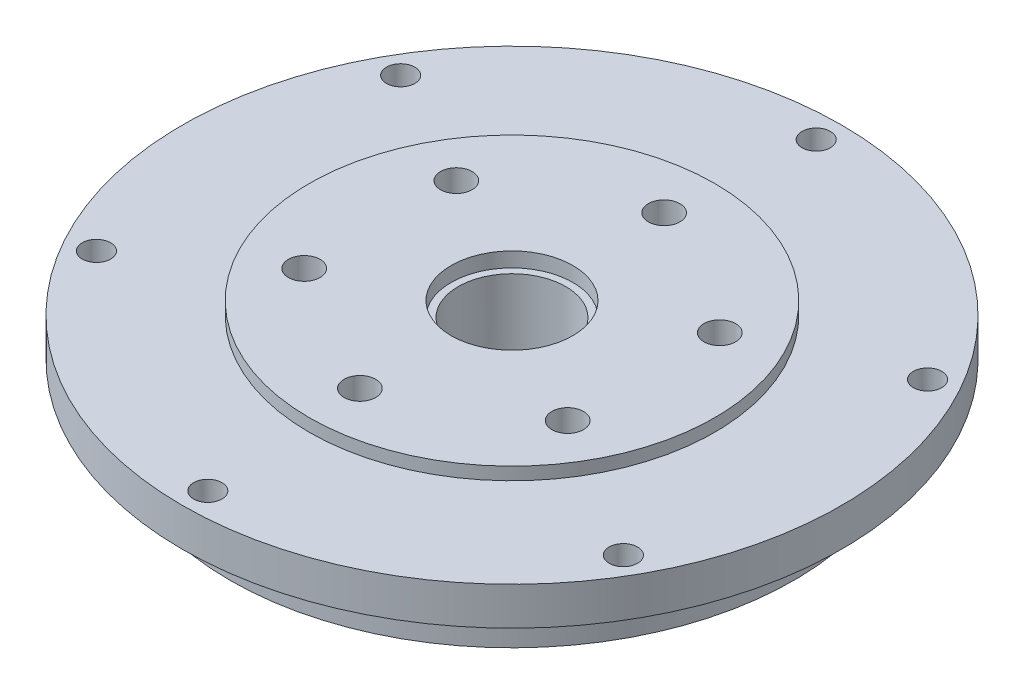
ISO-10303-21;
HEADER;
FILE_DESCRIPTION(('STEP AP214'),'2;1');
FILE_NAME('part.step','',(''),(''),'','','');
FILE_SCHEMA(('AUTOMOTIVE_DESIGN { 1 0 10303 214 1 1 1 1 }'));
ENDSEC;
DATA;
#1=APPLICATION_CONTEXT('core data for automotive mechanical design processes');
#2=APPLICATION_PROTOCOL_DEFINITION('international standard','automotive_design',2000,#1);
#3=PRODUCT_CONTEXT('',#1,'mechanical');
#4=PRODUCT('Part','Part','',(#3));
#5=PRODUCT_RELATED_PRODUCT_CATEGORY('part','',(#4));
#6=PRODUCT_DEFINITION_FORMATION('','',#4);
#7=PRODUCT_DEFINITION_CONTEXT('part definition',#1,'design');
#8=PRODUCT_DEFINITION('design','',#6,#7);
#9=PRODUCT_DEFINITION_SHAPE('','',#8);
#10=(LENGTH_UNIT() NAMED_UNIT(*) SI_UNIT(.MILLI.,.METRE.));
#11=(NAMED_UNIT(*) PLANE_ANGLE_UNIT() SI_UNIT($,.RADIAN.));
#12=(NAMED_UNIT(*) SI_UNIT($,.STERADIAN.) SOLID_ANGLE_UNIT());
#13=UNCERTAINTY_MEASURE_WITH_UNIT(LENGTH_MEASURE(1.E-05),#10,'distance_accuracy_value','');
#14=(GEOMETRIC_REPRESENTATION_CONTEXT(3) GLOBAL_UNCERTAINTY_ASSIGNED_CONTEXT((#13)) GLOBAL_UNIT_ASSIGNED_CONTEXT((#10,
#11,#12)) REPRESENTATION_CONTEXT('',''));
#15=CARTESIAN_POINT('',(0.,0.,0.));
#16=DIRECTION('',(0.,0.,1.));
#17=DIRECTION('',(1.,0.,0.));
#18=AXIS2_PLACEMENT_3D('',#15,#16,#17);
#19=CARTESIAN_POINT('',(0.,77.3658319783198,0.));
#20=DIRECTION('',(0.,1.,0.));
#21=DIRECTION('',(0.,0.,1.));
#22=AXIS2_PLACEMENT_3D('',#19,#20,#21);
#23=CYLINDRICAL_SURFACE('',#22,13.462);
#24=CARTESIAN_POINT('',(0.,21.717,0.));
#25=DIRECTION('',(0.,1.,0.));
#26=DIRECTION('',(0.,0.,1.));
#27=AXIS2_PLACEMENT_3D('',#24,#25,#26);
#28=CIRCLE('',#27,13.462);
#29=CARTESIAN_POINT('',(0.,21.717,13.462));
#30=VERTEX_POINT('',#29);
#31=EDGE_CURVE('E10',#30,#30,#28,.T.);
#32=ORIENTED_EDGE('',*,*,#31,.T.);
#33=EDGE_LOOP('',(#32));
#34=FACE_BOUND('',#33,.T.);
#35=CARTESIAN_POINT('',(0.,3.175,0.));
#36=DIRECTION('',(0.,-1.,0.));
#37=DIRECTION('',(0.,0.,-1.));
#38=AXIS2_PLACEMENT_3D('',#35,#36,#37);
#39=CIRCLE('',#38,13.462);
#40=CARTESIAN_POINT('',(0.,3.175,-13.462));
#41=VERTEX_POINT('',#40);
#42=EDGE_CURVE('E225',#41,#41,#39,.F.);
#43=ORIENTED_EDGE('',*,*,#42,.F.);
#44=EDGE_LOOP('',(#43));
#45=FACE_BOUND('',#44,.T.);
#46=ADVANCED_FACE('F34',(#34,#45),#23,.F.);
#47=CARTESIAN_POINT('',(70.612,0.,0.));
#48=DIRECTION('',(0.,1.,0.));
#49=DIRECTION('',(0.,0.,1.));
#50=AXIS2_PLACEMENT_3D('',#47,#48,#49);
#51=PLANE('',#50);
#52=CARTESIAN_POINT('',(0.,0.,0.));
#53=DIRECTION('',(0.,-1.,0.));
#54=DIRECTION('',(0.,0.,-1.));
#55=AXIS2_PLACEMENT_3D('',#52,#53,#54);
#56=CIRCLE('',#55,63.5635);
#57=CARTESIAN_POINT('',(0.,0.,-63.5635));
#58=VERTEX_POINT('',#57);
#59=EDGE_CURVE('E203',#58,#58,#56,.T.);
#60=ORIENTED_EDGE('',*,*,#59,.F.);
#61=EDGE_LOOP('',(#60));
#62=FACE_BOUND('',#61,.T.);
#63=CARTESIAN_POINT('',(0.,0.,0.));
#64=DIRECTION('',(0.,1.,0.));
#65=DIRECTION('',(0.,0.,1.));
#66=AXIS2_PLACEMENT_3D('',#63,#64,#65);
#67=CIRCLE('',#66,70.612);
#68=CARTESIAN_POINT('',(0.,0.,70.612));
#69=VERTEX_POINT('',#68);
#70=EDGE_CURVE('E54',#69,#69,#67,.T.);
#71=ORIENTED_EDGE('',*,*,#70,.F.);
#72=EDGE_LOOP('',(#71));
#73=FACE_BOUND('',#72,.T.);
#74=ADVANCED_FACE('F36',(#62,#73),#51,.F.);
#75=CARTESIAN_POINT('',(13.462,21.717,0.));
#76=DIRECTION('',(0.,-1.,0.));
#77=DIRECTION('',(0.,0.,-1.));
#78=AXIS2_PLACEMENT_3D('',#75,#76,#77);
#79=PLANE('',#78);
#80=ORIENTED_EDGE('',*,*,#31,.F.);
#81=EDGE_LOOP('',(#80));
#82=FACE_BOUND('',#81,.T.);
#83=CARTESIAN_POINT('',(0.,21.717,0.));
#84=DIRECTION('',(0.,1.,0.));
#85=DIRECTION('',(0.,0.,1.));
#86=AXIS2_PLACEMENT_3D('',#83,#84,#85);
#87=CIRCLE('',#86,15.24);
#88=CARTESIAN_POINT('',(0.,21.717,15.24));
#89=VERTEX_POINT('',#88);
#90=EDGE_CURVE('E42',#89,#89,#87,.T.);
#91=ORIENTED_EDGE('',*,*,#90,.T.);
#92=EDGE_LOOP('',(#91));
#93=FACE_BOUND('',#92,.T.);
#94=ADVANCED_FACE('F193',(#82,#93),#79,.F.);
#95=CARTESIAN_POINT('',(0.,77.3658319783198,0.));
#96=DIRECTION('',(0.,1.,0.));
#97=DIRECTION('',(0.,0.,1.));
#98=AXIS2_PLACEMENT_3D('',#95,#96,#97);
#99=CYLINDRICAL_SURFACE('',#98,15.24);
#100=ORIENTED_EDGE('',*,*,#90,.F.);
#101=EDGE_LOOP('',(#100));
#102=FACE_BOUND('',#101,.T.);
#103=CARTESIAN_POINT('',(0.,25.4,0.));
#104=DIRECTION('',(0.,1.,0.));
#105=DIRECTION('',(0.,0.,1.));
#106=AXIS2_PLACEMENT_3D('',#103,#104,#105);
#107=CIRCLE('',#106,15.24);
#108=CARTESIAN_POINT('',(0.,25.4,15.24));
#109=VERTEX_POINT('',#108);
#110=EDGE_CURVE('E47',#109,#109,#107,.T.);
#111=ORIENTED_EDGE('',*,*,#110,.T.);
#112=EDGE_LOOP('',(#111));
#113=FACE_BOUND('',#112,.T.);
#114=ADVANCED_FACE('F127',(#102,#113),#99,.F.);
#115=CARTESIAN_POINT('',(50.8,25.4,0.));
#116=DIRECTION('',(0.,-1.,0.));
#117=DIRECTION('',(0.,0.,-1.));
#118=AXIS2_PLACEMENT_3D('',#115,#116,#117);
#119=PLANE('',#118);
#120=CARTESIAN_POINT('',(-32.9955678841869,25.4,-19.0500000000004));
#121=DIRECTION('',(0.,1.,0.));
#122=DIRECTION('',(0.866025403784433,0.,0.50000000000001));
#123=AXIS2_PLACEMENT_3D('',#120,#121,#122);
#124=CIRCLE('',#123,3.9624);
#125=CARTESIAN_POINT('',(-32.9955678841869,25.4,-15.0876000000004));
#126=VERTEX_POINT('',#125);
#127=EDGE_CURVE('E246',#126,#126,#124,.T.);
#128=ORIENTED_EDGE('',*,*,#127,.F.);
#129=EDGE_LOOP('',(#128));
#130=FACE_BOUND('',#129,.T.);
#131=CARTESIAN_POINT('',(-32.9955678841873,25.4,19.0499999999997));
#132=DIRECTION('',(0.,1.,0.));
#133=DIRECTION('',(0.866025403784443,0.,-0.499999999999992));
#134=AXIS2_PLACEMENT_3D('',#131,#132,#133);
#135=CIRCLE('',#134,3.9624);
#136=CARTESIAN_POINT('',(-32.9955678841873,25.4,23.0123999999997));
#137=VERTEX_POINT('',#136);
#138=EDGE_CURVE('E252',#137,#137,#135,.T.);
#139=ORIENTED_EDGE('',*,*,#138,.F.);
#140=EDGE_LOOP('',(#139));
#141=FACE_BOUND('',#140,.T.);
#142=CARTESIAN_POINT('',(-2.66051032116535E-13,25.4,38.1));
#143=DIRECTION('',(0.,1.,0.));
#144=DIRECTION('',(0.,0.,-1.));
#145=AXIS2_PLACEMENT_3D('',#142,#143,#144);
#146=CIRCLE('',#145,3.9624);
#147=CARTESIAN_POINT('',(-2.66051032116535E-13,25.4,42.0624));
#148=VERTEX_POINT('',#147);
#149=EDGE_CURVE('E258',#148,#148,#146,.T.);
#150=ORIENTED_EDGE('',*,*,#149,.F.);
#151=EDGE_LOOP('',(#150));
#152=FACE_BOUND('',#151,.T.);
#153=CARTESIAN_POINT('',(32.995567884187,25.4,19.0500000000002));
#154=DIRECTION('',(0.,1.,0.));
#155=DIRECTION('',(-0.866025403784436,0.,-0.500000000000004));
#156=AXIS2_PLACEMENT_3D('',#153,#154,#155);
#157=CIRCLE('',#156,3.9624);
#158=CARTESIAN_POINT('',(32.995567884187,25.4,23.0124000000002));
#159=VERTEX_POINT('',#158);
#160=EDGE_CURVE('E264',#159,#159,#157,.T.);
#161=ORIENTED_EDGE('',*,*,#160,.F.);
#162=EDGE_LOOP('',(#161));
#163=FACE_BOUND('',#162,.T.);
#164=CARTESIAN_POINT('',(32.9955678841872,25.4,-19.0499999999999));
#165=DIRECTION('',(0.,1.,0.));
#166=DIRECTION('',(-0.86602540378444,0.,0.499999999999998));
#167=AXIS2_PLACEMENT_3D('',#164,#165,#166);
#168=CIRCLE('',#167,3.9624);
#169=CARTESIAN_POINT('',(32.9955678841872,25.4,-15.0875999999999));
#170=VERTEX_POINT('',#169);
#171=EDGE_CURVE('E270',#170,#170,#168,.T.);
#172=ORIENTED_EDGE('',*,*,#171,.F.);
#173=EDGE_LOOP('',(#172));
#174=FACE_BOUND('',#173,.T.);
#175=CARTESIAN_POINT('',(0.,25.4,-38.1));
#176=DIRECTION('',(0.,1.,0.));
#177=DIRECTION('',(0.,0.,1.));
#178=AXIS2_PLACEMENT_3D('',#175,#176,#177);
#179=CIRCLE('',#178,3.9624);
#180=CARTESIAN_POINT('',(0.,25.4,-34.1376));
#181=VERTEX_POINT('',#180);
#182=EDGE_CURVE('E84',#181,#181,#179,.T.);
#183=ORIENTED_EDGE('',*,*,#182,.F.);
#184=EDGE_LOOP('',(#183));
#185=FACE_BOUND('',#184,.T.);
#186=ORIENTED_EDGE('',*,*,#110,.F.);
#187=EDGE_LOOP('',(#186));
#188=FACE_BOUND('',#187,.T.);
#189=CARTESIAN_POINT('',(0.,25.4,0.));
#190=DIRECTION('',(0.,1.,0.));
#191=DIRECTION('',(0.,0.,1.));
#192=AXIS2_PLACEMENT_3D('',#189,#190,#191);
#193=CIRCLE('',#192,50.8);
#194=CARTESIAN_POINT('',(0.,25.4,50.8));
#195=VERTEX_POINT('',#194);
#196=EDGE_CURVE('E122',#195,#195,#193,.T.);
#197=ORIENTED_EDGE('',*,*,#196,.T.);
#198=EDGE_LOOP('',(#197));
#199=FACE_BOUND('',#198,.T.);
#200=ADVANCED_FACE('F129',(#130,#141,#152,#163,#174,#185,#188,#199),#119,.F.);
#201=CARTESIAN_POINT('',(0.,77.3658319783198,0.));
#202=DIRECTION('',(0.,1.,0.));
#203=DIRECTION('',(0.,0.,1.));
#204=AXIS2_PLACEMENT_3D('',#201,#202,#203);
#205=CYLINDRICAL_SURFACE('',#204,50.8);
#206=ORIENTED_EDGE('',*,*,#196,.F.);
#207=EDGE_LOOP('',(#206));
#208=FACE_BOUND('',#207,.T.);
#209=CARTESIAN_POINT('',(0.,22.225,0.));
#210=DIRECTION('',(0.,1.,0.));
#211=DIRECTION('',(0.,0.,1.));
#212=AXIS2_PLACEMENT_3D('',#209,#210,#211);
#213=CIRCLE('',#212,50.8);
#214=CARTESIAN_POINT('',(0.,22.225,50.8));
#215=VERTEX_POINT('',#214);
#216=EDGE_CURVE('E119',#215,#215,#213,.T.);
#217=ORIENTED_EDGE('',*,*,#216,.T.);
#218=EDGE_LOOP('',(#217));
#219=FACE_BOUND('',#218,.T.);
#220=ADVANCED_FACE('F132',(#208,#219),#205,.T.);
#221=CARTESIAN_POINT('',(50.8,22.225,0.));
#222=DIRECTION('',(0.,-1.,0.));
#223=DIRECTION('',(0.,0.,-1.));
#224=AXIS2_PLACEMENT_3D('',#221,#222,#223);
#225=PLANE('',#224);
#226=CARTESIAN_POINT('',(-65.9911357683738,22.225,-38.1000000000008));
#227=DIRECTION('',(0.,1.,0.));
#228=DIRECTION('',(0.866025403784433,0.,0.50000000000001));
#229=AXIS2_PLACEMENT_3D('',#226,#227,#228);
#230=CIRCLE('',#229,3.556);
#231=CARTESIAN_POINT('',(-62.9115494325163,22.225,-36.3220000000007));
#232=VERTEX_POINT('',#231);
#233=EDGE_CURVE('E73',#232,#232,#230,.T.);
#234=ORIENTED_EDGE('',*,*,#233,.F.);
#235=EDGE_LOOP('',(#234));
#236=FACE_BOUND('',#235,.T.);
#237=CARTESIAN_POINT('',(-65.9911357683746,22.225,38.0999999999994));
#238=DIRECTION('',(0.,1.,0.));
#239=DIRECTION('',(0.866025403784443,0.,-0.499999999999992));
#240=AXIS2_PLACEMENT_3D('',#237,#238,#239);
#241=CIRCLE('',#240,3.556);
#242=CARTESIAN_POINT('',(-62.9115494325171,22.225,36.3219999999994));
#243=VERTEX_POINT('',#242);
#244=EDGE_CURVE('E70',#243,#243,#241,.T.);
#245=ORIENTED_EDGE('',*,*,#244,.F.);
#246=EDGE_LOOP('',(#245));
#247=FACE_BOUND('',#246,.T.);
#248=CARTESIAN_POINT('',(-5.3210206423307E-13,22.225,76.2));
#249=DIRECTION('',(0.,1.,0.));
#250=DIRECTION('',(0.,0.,-1.));
#251=AXIS2_PLACEMENT_3D('',#248,#249,#250);
#252=CIRCLE('',#251,3.556);
#253=CARTESIAN_POINT('',(-5.0727063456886E-13,22.225,72.644));
#254=VERTEX_POINT('',#253);
#255=EDGE_CURVE('E67',#254,#254,#252,.T.);
#256=ORIENTED_EDGE('',*,*,#255,.F.);
#257=EDGE_LOOP('',(#256));
#258=FACE_BOUND('',#257,.T.);
#259=CARTESIAN_POINT('',(65.9911357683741,22.225,38.1000000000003));
#260=DIRECTION('',(0.,1.,0.));
#261=DIRECTION('',(-0.866025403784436,0.,-0.500000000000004));
#262=AXIS2_PLACEMENT_3D('',#259,#260,#261);
#263=CIRCLE('',#262,3.556);
#264=CARTESIAN_POINT('',(62.9115494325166,22.225,36.3220000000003));
#265=VERTEX_POINT('',#264);
#266=EDGE_CURVE('E63',#265,#265,#263,.T.);
#267=ORIENTED_EDGE('',*,*,#266,.F.);
#268=EDGE_LOOP('',(#267));
#269=FACE_BOUND('',#268,.T.);
#270=CARTESIAN_POINT('',(65.9911357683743,22.225,-38.0999999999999));
#271=DIRECTION('',(0.,1.,0.));
#272=DIRECTION('',(-0.86602540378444,0.,0.499999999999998));
#273=AXIS2_PLACEMENT_3D('',#270,#271,#272);
#274=CIRCLE('',#273,3.556);
#275=CARTESIAN_POINT('',(62.9115494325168,22.225,-36.3219999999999));
#276=VERTEX_POINT('',#275);
#277=EDGE_CURVE('E59',#276,#276,#274,.T.);
#278=ORIENTED_EDGE('',*,*,#277,.F.);
#279=EDGE_LOOP('',(#278));
#280=FACE_BOUND('',#279,.T.);
#281=CARTESIAN_POINT('',(0.,22.225,-76.2));
#282=DIRECTION('',(0.,1.,0.));
#283=DIRECTION('',(0.,0.,1.));
#284=AXIS2_PLACEMENT_3D('',#281,#282,#283);
#285=CIRCLE('',#284,3.556);
#286=CARTESIAN_POINT('',(0.,22.225,-72.644));
#287=VERTEX_POINT('',#286);
#288=EDGE_CURVE('E55',#287,#287,#285,.T.);
#289=ORIENTED_EDGE('',*,*,#288,.F.);
#290=EDGE_LOOP('',(#289));
#291=FACE_BOUND('',#290,.T.);
#292=ORIENTED_EDGE('',*,*,#216,.F.);
#293=EDGE_LOOP('',(#292));
#294=FACE_BOUND('',#293,.T.);
#295=CARTESIAN_POINT('',(0.,22.225,0.));
#296=DIRECTION('',(0.,1.,0.));
#297=DIRECTION('',(0.,0.,1.));
#298=AXIS2_PLACEMENT_3D('',#295,#296,#297);
#299=CIRCLE('',#298,82.55);
#300=CARTESIAN_POINT('',(0.,22.225,82.55));
#301=VERTEX_POINT('',#300);
#302=EDGE_CURVE('E116',#301,#301,#299,.T.);
#303=ORIENTED_EDGE('',*,*,#302,.T.);
#304=EDGE_LOOP('',(#303));
#305=FACE_BOUND('',#304,.T.);
#306=ADVANCED_FACE('F139',(#236,#247,#258,#269,#280,#291,#294,#305),#225,.F.);
#307=CARTESIAN_POINT('',(0.,77.3658319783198,0.));
#308=DIRECTION('',(0.,1.,0.));
#309=DIRECTION('',(0.,0.,1.));
#310=AXIS2_PLACEMENT_3D('',#307,#308,#309);
#311=CYLINDRICAL_SURFACE('',#310,82.55);
#312=ORIENTED_EDGE('',*,*,#302,.F.);
#313=EDGE_LOOP('',(#312));
#314=FACE_BOUND('',#313,.T.);
#315=CARTESIAN_POINT('',(0.,12.7,0.));
#316=DIRECTION('',(0.,1.,0.));
#317=DIRECTION('',(0.,0.,1.));
#318=AXIS2_PLACEMENT_3D('',#315,#316,#317);
#319=CIRCLE('',#318,82.55);
#320=CARTESIAN_POINT('',(0.,12.7,82.55));
#321=VERTEX_POINT('',#320);
#322=EDGE_CURVE('E113',#321,#321,#319,.T.);
#323=ORIENTED_EDGE('',*,*,#322,.T.);
#324=EDGE_LOOP('',(#323));
#325=FACE_BOUND('',#324,.T.);
#326=ADVANCED_FACE('F145',(#314,#325),#311,.T.);
#327=CARTESIAN_POINT('',(82.55,12.7,0.));
#328=DIRECTION('',(0.,1.,0.));
#329=DIRECTION('',(0.,0.,1.));
#330=AXIS2_PLACEMENT_3D('',#327,#328,#329);
#331=PLANE('',#330);
#332=CARTESIAN_POINT('',(-65.9911357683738,12.7,-38.1000000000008));
#333=DIRECTION('',(0.,1.,0.));
#334=DIRECTION('',(0.,0.,1.));
#335=AXIS2_PLACEMENT_3D('',#332,#333,#334);
#336=CIRCLE('',#335,3.556);
#337=CARTESIAN_POINT('',(-65.9911357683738,12.7,-34.5440000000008));
#338=VERTEX_POINT('',#337);
#339=EDGE_CURVE('E71',#338,#338,#336,.T.);
#340=ORIENTED_EDGE('',*,*,#339,.T.);
#341=EDGE_LOOP('',(#340));
#342=FACE_BOUND('',#341,.T.);
#343=CARTESIAN_POINT('',(-65.9911357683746,12.7,38.0999999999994));
#344=DIRECTION('',(0.,1.,0.));
#345=DIRECTION('',(0.,0.,1.));
#346=AXIS2_PLACEMENT_3D('',#343,#344,#345);
#347=CIRCLE('',#346,3.556);
#348=CARTESIAN_POINT('',(-65.9911357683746,12.7,41.6559999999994));
#349=VERTEX_POINT('',#348);
#350=EDGE_CURVE('E68',#349,#349,#347,.T.);
#351=ORIENTED_EDGE('',*,*,#350,.T.);
#352=EDGE_LOOP('',(#351));
#353=FACE_BOUND('',#352,.T.);
#354=CARTESIAN_POINT('',(-5.3210206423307E-13,12.7,76.2));
#355=DIRECTION('',(0.,1.,0.));
#356=DIRECTION('',(0.,0.,1.));
#357=AXIS2_PLACEMENT_3D('',#354,#355,#356);
#358=CIRCLE('',#357,3.556);
#359=CARTESIAN_POINT('',(-5.3210206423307E-13,12.7,79.756));
#360=VERTEX_POINT('',#359);
#361=EDGE_CURVE('E64',#360,#360,#358,.T.);
#362=ORIENTED_EDGE('',*,*,#361,.T.);
#363=EDGE_LOOP('',(#362));
#364=FACE_BOUND('',#363,.T.);
#365=CARTESIAN_POINT('',(65.9911357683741,12.7,38.1000000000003));
#366=DIRECTION('',(0.,1.,0.));
#367=DIRECTION('',(0.,0.,1.));
#368=AXIS2_PLACEMENT_3D('',#365,#366,#367);
#369=CIRCLE('',#368,3.556);
#370=CARTESIAN_POINT('',(65.9911357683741,12.7,41.6560000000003));
#371=VERTEX_POINT('',#370);
#372=EDGE_CURVE('E60',#371,#371,#369,.T.);
#373=ORIENTED_EDGE('',*,*,#372,.T.);
#374=EDGE_LOOP('',(#373));
#375=FACE_BOUND('',#374,.T.);
#376=CARTESIAN_POINT('',(65.9911357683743,12.7,-38.0999999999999));
#377=DIRECTION('',(0.,1.,0.));
#378=DIRECTION('',(0.,0.,1.));
#379=AXIS2_PLACEMENT_3D('',#376,#377,#378);
#380=CIRCLE('',#379,3.556);
#381=CARTESIAN_POINT('',(65.9911357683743,12.7,-34.5439999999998));
#382=VERTEX_POINT('',#381);
#383=EDGE_CURVE('E56',#382,#382,#380,.T.);
#384=ORIENTED_EDGE('',*,*,#383,.T.);
#385=EDGE_LOOP('',(#384));
#386=FACE_BOUND('',#385,.T.);
#387=CARTESIAN_POINT('',(0.,12.7,-76.2));
#388=DIRECTION('',(0.,1.,0.));
#389=DIRECTION('',(0.,0.,1.));
#390=AXIS2_PLACEMENT_3D('',#387,#388,#389);
#391=CIRCLE('',#390,3.556);
#392=CARTESIAN_POINT('',(0.,12.7,-72.644));
#393=VERTEX_POINT('',#392);
#394=EDGE_CURVE('E51',#393,#393,#391,.T.);
#395=ORIENTED_EDGE('',*,*,#394,.T.);
#396=EDGE_LOOP('',(#395));
#397=FACE_BOUND('',#396,.T.);
#398=ORIENTED_EDGE('',*,*,#322,.F.);
#399=EDGE_LOOP('',(#398));
#400=FACE_BOUND('',#399,.T.);
#401=CARTESIAN_POINT('',(0.,12.7,0.));
#402=DIRECTION('',(0.,1.,0.));
#403=DIRECTION('',(0.,0.,1.));
#404=AXIS2_PLACEMENT_3D('',#401,#402,#403);
#405=CIRCLE('',#404,70.612);
#406=CARTESIAN_POINT('',(0.,12.7,70.612));
#407=VERTEX_POINT('',#406);
#408=EDGE_CURVE('E110',#407,#407,#405,.T.);
#409=ORIENTED_EDGE('',*,*,#408,.T.);
#410=EDGE_LOOP('',(#409));
#411=FACE_BOUND('',#410,.T.);
#412=ADVANCED_FACE('F152',(#342,#353,#364,#375,#386,#397,#400,#411),#331,.F.);
#413=CARTESIAN_POINT('',(0.,77.3658319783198,0.));
#414=DIRECTION('',(0.,1.,0.));
#415=DIRECTION('',(0.,0.,1.));
#416=AXIS2_PLACEMENT_3D('',#413,#414,#415);
#417=CYLINDRICAL_SURFACE('',#416,70.612);
#418=ORIENTED_EDGE('',*,*,#408,.F.);
#419=EDGE_LOOP('',(#418));
#420=FACE_BOUND('',#419,.T.);
#421=CARTESIAN_POINT('',(0.,8.8138,0.));
#422=DIRECTION('',(0.,1.,0.));
#423=DIRECTION('',(0.,0.,1.));
#424=AXIS2_PLACEMENT_3D('',#421,#422,#423);
#425=CIRCLE('',#424,70.612);
#426=CARTESIAN_POINT('',(0.,8.8138,70.612));
#427=VERTEX_POINT('',#426);
#428=EDGE_CURVE('E107',#427,#427,#425,.T.);
#429=ORIENTED_EDGE('',*,*,#428,.T.);
#430=EDGE_LOOP('',(#429));
#431=FACE_BOUND('',#430,.T.);
#432=ADVANCED_FACE('F158',(#420,#431),#417,.T.);
#433=CARTESIAN_POINT('',(70.612,8.8138,0.));
#434=DIRECTION('',(0.,1.,0.));
#435=DIRECTION('',(0.,0.,1.));
#436=AXIS2_PLACEMENT_3D('',#433,#434,#435);
#437=PLANE('',#436);
#438=ORIENTED_EDGE('',*,*,#428,.F.);
#439=EDGE_LOOP('',(#438));
#440=FACE_BOUND('',#439,.T.);
#441=CARTESIAN_POINT('',(0.,8.8138,0.));
#442=DIRECTION('',(0.,1.,0.));
#443=DIRECTION('',(0.,0.,1.));
#444=AXIS2_PLACEMENT_3D('',#441,#442,#443);
#445=CIRCLE('',#444,67.564);
#446=CARTESIAN_POINT('',(0.,8.8138,67.564));
#447=VERTEX_POINT('',#446);
#448=EDGE_CURVE('E104',#447,#447,#445,.T.);
#449=ORIENTED_EDGE('',*,*,#448,.T.);
#450=EDGE_LOOP('',(#449));
#451=FACE_BOUND('',#450,.T.);
#452=ADVANCED_FACE('F164',(#440,#451),#437,.F.);
#453=CARTESIAN_POINT('',(0.,77.3658319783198,0.));
#454=DIRECTION('',(0.,1.,0.));
#455=DIRECTION('',(0.,0.,1.));
#456=AXIS2_PLACEMENT_3D('',#453,#454,#455);
#457=CYLINDRICAL_SURFACE('',#456,67.564);
#458=ORIENTED_EDGE('',*,*,#448,.F.);
#459=EDGE_LOOP('',(#458));
#460=FACE_BOUND('',#459,.T.);
#461=CARTESIAN_POINT('',(0.,4.7498,0.));
#462=DIRECTION('',(0.,1.,0.));
#463=DIRECTION('',(0.,0.,1.));
#464=AXIS2_PLACEMENT_3D('',#461,#462,#463);
#465=CIRCLE('',#464,67.564);
#466=CARTESIAN_POINT('',(0.,4.7498,67.564));
#467=VERTEX_POINT('',#466);
#468=EDGE_CURVE('E101',#467,#467,#465,.T.);
#469=ORIENTED_EDGE('',*,*,#468,.T.);
#470=EDGE_LOOP('',(#469));
#471=FACE_BOUND('',#470,.T.);
#472=ADVANCED_FACE('F170',(#460,#471),#457,.T.);
#473=CARTESIAN_POINT('',(67.564,4.7498,0.));
#474=DIRECTION('',(0.,-1.,0.));
#475=DIRECTION('',(0.,0.,-1.));
#476=AXIS2_PLACEMENT_3D('',#473,#474,#475);
#477=PLANE('',#476);
#478=ORIENTED_EDGE('',*,*,#468,.F.);
#479=EDGE_LOOP('',(#478));
#480=FACE_BOUND('',#479,.T.);
#481=CARTESIAN_POINT('',(0.,4.7498,0.));
#482=DIRECTION('',(0.,1.,0.));
#483=DIRECTION('',(0.,0.,1.));
#484=AXIS2_PLACEMENT_3D('',#481,#482,#483);
#485=CIRCLE('',#484,70.612);
#486=CARTESIAN_POINT('',(0.,4.7498,70.612));
#487=VERTEX_POINT('',#486);
#488=EDGE_CURVE('E98',#487,#487,#485,.T.);
#489=ORIENTED_EDGE('',*,*,#488,.T.);
#490=EDGE_LOOP('',(#489));
#491=FACE_BOUND('',#490,.T.);
#492=ADVANCED_FACE('F176',(#480,#491),#477,.F.);
#493=CARTESIAN_POINT('',(0.,77.3658319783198,0.));
#494=DIRECTION('',(0.,1.,0.));
#495=DIRECTION('',(0.,0.,1.));
#496=AXIS2_PLACEMENT_3D('',#493,#494,#495);
#497=CYLINDRICAL_SURFACE('',#496,70.612);
#498=ORIENTED_EDGE('',*,*,#488,.F.);
#499=EDGE_LOOP('',(#498));
#500=FACE_BOUND('',#499,.T.);
#501=ORIENTED_EDGE('',*,*,#70,.T.);
#502=EDGE_LOOP('',(#501));
#503=FACE_BOUND('',#502,.T.);
#504=ADVANCED_FACE('F182',(#500,#503),#497,.T.);
#505=CARTESIAN_POINT('',(0.,0.,-76.2));
#506=DIRECTION('',(0.,1.,0.));
#507=DIRECTION('',(0.,0.,1.));
#508=AXIS2_PLACEMENT_3D('',#505,#506,#507);
#509=CYLINDRICAL_SURFACE('',#508,3.556);
#510=ORIENTED_EDGE('',*,*,#288,.T.);
#511=EDGE_LOOP('',(#510));
#512=FACE_BOUND('',#511,.T.);
#513=ORIENTED_EDGE('',*,*,#394,.F.);
#514=EDGE_LOOP('',(#513));
#515=FACE_BOUND('',#514,.T.);
#516=ADVANCED_FACE('F188',(#512,#515),#509,.F.);
#517=CARTESIAN_POINT('',(65.9911357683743,0.,-38.0999999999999));
#518=DIRECTION('',(0.,1.,0.));
#519=DIRECTION('',(0.,0.,1.));
#520=AXIS2_PLACEMENT_3D('',#517,#518,#519);
#521=CYLINDRICAL_SURFACE('',#520,3.556);
#522=ORIENTED_EDGE('',*,*,#277,.T.);
#523=EDGE_LOOP('',(#522));
#524=FACE_BOUND('',#523,.T.);
#525=ORIENTED_EDGE('',*,*,#383,.F.);
#526=EDGE_LOOP('',(#525));
#527=FACE_BOUND('',#526,.T.);
#528=ADVANCED_FACE('F307',(#524,#527),#521,.F.);
#529=CARTESIAN_POINT('',(65.9911357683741,0.,38.1000000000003));
#530=DIRECTION('',(0.,1.,0.));
#531=DIRECTION('',(0.,0.,1.));
#532=AXIS2_PLACEMENT_3D('',#529,#530,#531);
#533=CYLINDRICAL_SURFACE('',#532,3.556);
#534=ORIENTED_EDGE('',*,*,#266,.T.);
#535=EDGE_LOOP('',(#534));
#536=FACE_BOUND('',#535,.T.);
#537=ORIENTED_EDGE('',*,*,#372,.F.);
#538=EDGE_LOOP('',(#537));
#539=FACE_BOUND('',#538,.T.);
#540=ADVANCED_FACE('F303',(#536,#539),#533,.F.);
#541=CARTESIAN_POINT('',(-5.3210206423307E-13,0.,76.2));
#542=DIRECTION('',(0.,1.,0.));
#543=DIRECTION('',(0.,0.,1.));
#544=AXIS2_PLACEMENT_3D('',#541,#542,#543);
#545=CYLINDRICAL_SURFACE('',#544,3.556);
#546=ORIENTED_EDGE('',*,*,#255,.T.);
#547=EDGE_LOOP('',(#546));
#548=FACE_BOUND('',#547,.T.);
#549=ORIENTED_EDGE('',*,*,#361,.F.);
#550=EDGE_LOOP('',(#549));
#551=FACE_BOUND('',#550,.T.);
#552=ADVANCED_FACE('F299',(#548,#551),#545,.F.);
#553=CARTESIAN_POINT('',(-65.9911357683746,0.,38.0999999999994));
#554=DIRECTION('',(0.,1.,0.));
#555=DIRECTION('',(0.,0.,1.));
#556=AXIS2_PLACEMENT_3D('',#553,#554,#555);
#557=CYLINDRICAL_SURFACE('',#556,3.556);
#558=ORIENTED_EDGE('',*,*,#244,.T.);
#559=EDGE_LOOP('',(#558));
#560=FACE_BOUND('',#559,.T.);
#561=ORIENTED_EDGE('',*,*,#350,.F.);
#562=EDGE_LOOP('',(#561));
#563=FACE_BOUND('',#562,.T.);
#564=ADVANCED_FACE('F292',(#560,#563),#557,.F.);
#565=CARTESIAN_POINT('',(-65.9911357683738,0.,-38.1000000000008));
#566=DIRECTION('',(0.,1.,0.));
#567=DIRECTION('',(0.,0.,1.));
#568=AXIS2_PLACEMENT_3D('',#565,#566,#567);
#569=CYLINDRICAL_SURFACE('',#568,3.556);
#570=ORIENTED_EDGE('',*,*,#233,.T.);
#571=EDGE_LOOP('',(#570));
#572=FACE_BOUND('',#571,.T.);
#573=ORIENTED_EDGE('',*,*,#339,.F.);
#574=EDGE_LOOP('',(#573));
#575=FACE_BOUND('',#574,.T.);
#576=ADVANCED_FACE('F282',(#572,#575),#569,.F.);
#577=CARTESIAN_POINT('',(0.,6.34999999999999,-38.1));
#578=DIRECTION('',(0.,1.,0.));
#579=DIRECTION('',(0.,0.,1.));
#580=AXIS2_PLACEMENT_3D('',#577,#578,#579);
#581=CYLINDRICAL_SURFACE('',#580,3.9624);
#582=CARTESIAN_POINT('',(0.,6.34999999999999,-38.1));
#583=DIRECTION('',(0.,1.,0.));
#584=DIRECTION('',(0.,0.,1.));
#585=AXIS2_PLACEMENT_3D('',#582,#583,#584);
#586=CIRCLE('',#585,3.9624);
#587=CARTESIAN_POINT('',(0.,6.34999999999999,-34.1376));
#588=VERTEX_POINT('',#587);
#589=EDGE_CURVE('E79',#588,#588,#586,.T.);
#590=CARTESIAN_POINT('',(0.,6.34999999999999,-34.1376));
#591=CARTESIAN_POINT('',(0.,6.54843749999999,-34.1376));
#592=CARTESIAN_POINT('',(0.,6.74687499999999,-34.1376));
#593=CARTESIAN_POINT('',(0.,7.14374999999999,-34.1376));
#594=CARTESIAN_POINT('',(0.,7.34218749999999,-34.1376));
#595=CARTESIAN_POINT('',(0.,7.73906249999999,-34.1376));
#596=CARTESIAN_POINT('',(0.,7.93749999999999,-34.1376));
#597=CARTESIAN_POINT('',(0.,8.33437499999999,-34.1376));
#598=CARTESIAN_POINT('',(0.,8.53281249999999,-34.1376));
#599=CARTESIAN_POINT('',(0.,8.92968749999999,-34.1376));
#600=CARTESIAN_POINT('',(0.,9.12812499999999,-34.1376));
#601=CARTESIAN_POINT('',(0.,9.52499999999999,-34.1376));
#602=CARTESIAN_POINT('',(0.,9.72343749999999,-34.1376));
#603=CARTESIAN_POINT('',(0.,10.1203125,-34.1376));
#604=CARTESIAN_POINT('',(0.,10.31875,-34.1376));
#605=CARTESIAN_POINT('',(0.,10.715625,-34.1376));
#606=CARTESIAN_POINT('',(0.,10.9140625,-34.1376));
#607=CARTESIAN_POINT('',(0.,11.3109375,-34.1376));
#608=CARTESIAN_POINT('',(0.,11.509375,-34.1376));
#609=CARTESIAN_POINT('',(0.,11.90625,-34.1376));
#610=CARTESIAN_POINT('',(0.,12.1046875,-34.1376));
#611=CARTESIAN_POINT('',(0.,12.5015625,-34.1376));
#612=CARTESIAN_POINT('',(0.,12.7,-34.1376));
#613=CARTESIAN_POINT('',(0.,13.096875,-34.1376));
#614=CARTESIAN_POINT('',(0.,13.2953125,-34.1376));
#615=CARTESIAN_POINT('',(0.,13.6921875,-34.1376));
#616=CARTESIAN_POINT('',(0.,13.890625,-34.1376));
#617=CARTESIAN_POINT('',(0.,14.2875,-34.1376));
#618=CARTESIAN_POINT('',(0.,14.4859375,-34.1376));
#619=CARTESIAN_POINT('',(0.,14.8828125,-34.1376));
#620=CARTESIAN_POINT('',(0.,15.08125,-34.1376));
#621=CARTESIAN_POINT('',(0.,15.478125,-34.1376));
#622=CARTESIAN_POINT('',(0.,15.6765625,-34.1376));
#623=CARTESIAN_POINT('',(0.,16.0734375,-34.1376));
#624=CARTESIAN_POINT('',(0.,16.271875,-34.1376));
#625=CARTESIAN_POINT('',(0.,16.66875,-34.1376));
#626=CARTESIAN_POINT('',(0.,16.8671875,-34.1376));
#627=CARTESIAN_POINT('',(0.,17.2640625,-34.1376));
#628=CARTESIAN_POINT('',(0.,17.4625,-34.1376));
#629=CARTESIAN_POINT('',(0.,17.859375,-34.1376));
#630=CARTESIAN_POINT('',(0.,18.0578125,-34.1376));
#631=CARTESIAN_POINT('',(0.,18.4546875,-34.1376));
#632=CARTESIAN_POINT('',(0.,18.653125,-34.1376));
#633=CARTESIAN_POINT('',(0.,19.05,-34.1376));
#634=CARTESIAN_POINT('',(0.,19.2484375,-34.1376));
#635=CARTESIAN_POINT('',(0.,19.6453125,-34.1376));
#636=CARTESIAN_POINT('',(0.,19.84375,-34.1376));
#637=CARTESIAN_POINT('',(0.,20.240625,-34.1376));
#638=CARTESIAN_POINT('',(0.,20.4390625,-34.1376));
#639=CARTESIAN_POINT('',(0.,20.8359375,-34.1376));
#640=CARTESIAN_POINT('',(0.,21.034375,-34.1376));
#641=CARTESIAN_POINT('',(0.,21.43125,-34.1376));
#642=CARTESIAN_POINT('',(0.,21.6296875,-34.1376));
#643=CARTESIAN_POINT('',(0.,22.0265625,-34.1376));
#644=CARTESIAN_POINT('',(0.,22.225,-34.1376));
#645=CARTESIAN_POINT('',(0.,22.621875,-34.1376));
#646=CARTESIAN_POINT('',(0.,22.8203125,-34.1376));
#647=CARTESIAN_POINT('',(0.,23.2171875,-34.1376));
#648=CARTESIAN_POINT('',(0.,23.415625,-34.1376));
#649=CARTESIAN_POINT('',(0.,23.8125,-34.1376));
#650=CARTESIAN_POINT('',(0.,24.0109375,-34.1376));
#651=CARTESIAN_POINT('',(0.,24.4078125,-34.1376));
#652=CARTESIAN_POINT('',(0.,24.60625,-34.1376));
#653=CARTESIAN_POINT('',(0.,25.003125,-34.1376));
#654=CARTESIAN_POINT('',(0.,25.2015625,-34.1376));
#655=CARTESIAN_POINT('',(0.,25.4,-34.1376));
#656=B_SPLINE_CURVE_WITH_KNOTS('',3,(#590,#591,#592,#593,#594,#595,#596,#597,#598,#599,#600,
#601,#602,#603,#604,#605,#606,#607,#608,#609,#610,#611,#612,#613,#614,#615,#616,#617,#618,#619,
#620,#621,#622,#623,#624,#625,#626,#627,#628,#629,#630,#631,#632,#633,#634,#635,#636,#637,#638,
#639,#640,#641,#642,#643,#644,#645,#646,#647,#648,#649,#650,#651,#652,#653,#654,#655),
.UNSPECIFIED.,.F.,.F.,(4,2,2,2,2,2,2,2,2,2,2,2,2,2,2,2,2,2,2,2,2,2,2,2,2,2,2,2,2,2,2,2,4),(0.,
0.5953125,1.190625,1.7859375,2.38125,2.9765625,3.571875,4.1671875,4.7625,5.3578125,5.953125,
6.5484375,7.14375,7.7390625,8.334375,8.9296875,9.525,10.1203125,10.715625,11.3109375,11.90625,
12.5015625,13.096875,13.6921875,14.2875,14.8828125,15.478125,16.0734375,16.66875,17.2640625,
17.859375,18.4546875,19.05),.UNSPECIFIED.);
#657=EDGE_CURVE('BSEAM278',#588,#181,#656,.T.);
#658=ORIENTED_EDGE('',*,*,#589,.F.);
#659=ORIENTED_EDGE('',*,*,#182,.T.);
#660=ORIENTED_EDGE('',*,*,#657,.T.);
#661=ORIENTED_EDGE('',*,*,#657,.F.);
#662=EDGE_LOOP('',(#658,#660,#659,#661));
#663=FACE_BOUND('',#662,.T.);
#664=ADVANCED_FACE('F278',(#663),#581,.F.);
#665=CARTESIAN_POINT('',(0.,6.34999999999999,-38.1));
#666=DIRECTION('',(0.,1.,0.));
#667=DIRECTION('',(0.,0.,1.));
#668=AXIS2_PLACEMENT_3D('',#665,#666,#667);
#669=PLANE('',#668);
#670=ORIENTED_EDGE('',*,*,#589,.T.);
#671=EDGE_LOOP('',(#670));
#672=FACE_BOUND('',#671,.T.);
#673=ADVANCED_FACE('F281',(#672),#669,.T.);
#674=CARTESIAN_POINT('',(32.9955678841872,6.34999999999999,-19.0499999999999));
#675=DIRECTION('',(0.,1.,0.));
#676=DIRECTION('',(0.,0.,1.));
#677=AXIS2_PLACEMENT_3D('',#674,#675,#676);
#678=CYLINDRICAL_SURFACE('',#677,3.9624);
#679=CARTESIAN_POINT('',(32.9955678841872,6.34999999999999,-19.0499999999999));
#680=DIRECTION('',(0.,1.,0.));
#681=DIRECTION('',(-0.86602540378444,0.,0.499999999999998));
#682=AXIS2_PLACEMENT_3D('',#679,#680,#681);
#683=CIRCLE('',#682,3.9624);
#684=CARTESIAN_POINT('',(32.9955678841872,6.34999999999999,-15.0875999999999));
#685=VERTEX_POINT('',#684);
#686=EDGE_CURVE('E273',#685,#685,#683,.T.);
#687=CARTESIAN_POINT('',(32.9955678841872,6.34999999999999,-15.0875999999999));
#688=CARTESIAN_POINT('',(32.9955678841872,6.54843749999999,-15.0875999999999));
#689=CARTESIAN_POINT('',(32.9955678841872,6.74687499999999,-15.0875999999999));
#690=CARTESIAN_POINT('',(32.9955678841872,7.14374999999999,-15.0875999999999));
#691=CARTESIAN_POINT('',(32.9955678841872,7.34218749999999,-15.0875999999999));
#692=CARTESIAN_POINT('',(32.9955678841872,7.73906249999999,-15.0875999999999));
#693=CARTESIAN_POINT('',(32.9955678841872,7.93749999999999,-15.0875999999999));
#694=CARTESIAN_POINT('',(32.9955678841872,8.33437499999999,-15.0875999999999));
#695=CARTESIAN_POINT('',(32.9955678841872,8.53281249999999,-15.0875999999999));
#696=CARTESIAN_POINT('',(32.9955678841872,8.92968749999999,-15.0875999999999));
#697=CARTESIAN_POINT('',(32.9955678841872,9.12812499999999,-15.0875999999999));
#698=CARTESIAN_POINT('',(32.9955678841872,9.52499999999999,-15.0875999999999));
#699=CARTESIAN_POINT('',(32.9955678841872,9.72343749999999,-15.0875999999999));
#700=CARTESIAN_POINT('',(32.9955678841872,10.1203125,-15.0875999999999));
#701=CARTESIAN_POINT('',(32.9955678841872,10.31875,-15.0875999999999));
#702=CARTESIAN_POINT('',(32.9955678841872,10.715625,-15.0875999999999));
#703=CARTESIAN_POINT('',(32.9955678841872,10.9140625,-15.0875999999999));
#704=CARTESIAN_POINT('',(32.9955678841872,11.3109375,-15.0875999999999));
#705=CARTESIAN_POINT('',(32.9955678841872,11.509375,-15.0875999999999));
#706=CARTESIAN_POINT('',(32.9955678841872,11.90625,-15.0875999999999));
#707=CARTESIAN_POINT('',(32.9955678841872,12.1046875,-15.0875999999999));
#708=CARTESIAN_POINT('',(32.9955678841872,12.5015625,-15.0875999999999));
#709=CARTESIAN_POINT('',(32.9955678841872,12.7,-15.0875999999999));
#710=CARTESIAN_POINT('',(32.9955678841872,13.096875,-15.0875999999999));
#711=CARTESIAN_POINT('',(32.9955678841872,13.2953125,-15.0875999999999));
#712=CARTESIAN_POINT('',(32.9955678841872,13.6921875,-15.0875999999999));
#713=CARTESIAN_POINT('',(32.9955678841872,13.890625,-15.0875999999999));
#714=CARTESIAN_POINT('',(32.9955678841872,14.2875,-15.0875999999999));
#715=CARTESIAN_POINT('',(32.9955678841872,14.4859375,-15.0875999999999));
#716=CARTESIAN_POINT('',(32.9955678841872,14.8828125,-15.0875999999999));
#717=CARTESIAN_POINT('',(32.9955678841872,15.08125,-15.0875999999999));
#718=CARTESIAN_POINT('',(32.9955678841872,15.478125,-15.0875999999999));
#719=CARTESIAN_POINT('',(32.9955678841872,15.6765625,-15.0875999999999));
#720=CARTESIAN_POINT('',(32.9955678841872,16.0734375,-15.0875999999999));
#721=CARTESIAN_POINT('',(32.9955678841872,16.271875,-15.0875999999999));
#722=CARTESIAN_POINT('',(32.9955678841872,16.66875,-15.0875999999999));
#723=CARTESIAN_POINT('',(32.9955678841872,16.8671875,-15.0875999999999));
#724=CARTESIAN_POINT('',(32.9955678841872,17.2640625,-15.0875999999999));
#725=CARTESIAN_POINT('',(32.9955678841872,17.4625,-15.0875999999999));
#726=CARTESIAN_POINT('',(32.9955678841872,17.859375,-15.0875999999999));
#727=CARTESIAN_POINT('',(32.9955678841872,18.0578125,-15.0875999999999));
#728=CARTESIAN_POINT('',(32.9955678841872,18.4546875,-15.0875999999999));
#729=CARTESIAN_POINT('',(32.9955678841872,18.653125,-15.0875999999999));
#730=CARTESIAN_POINT('',(32.9955678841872,19.05,-15.0875999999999));
#731=CARTESIAN_POINT('',(32.9955678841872,19.2484375,-15.0875999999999));
#732=CARTESIAN_POINT('',(32.9955678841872,19.6453125,-15.0875999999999));
#733=CARTESIAN_POINT('',(32.9955678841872,19.84375,-15.0875999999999));
#734=CARTESIAN_POINT('',(32.9955678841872,20.240625,-15.0875999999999));
#735=CARTESIAN_POINT('',(32.9955678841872,20.4390625,-15.0875999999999));
#736=CARTESIAN_POINT('',(32.9955678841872,20.8359375,-15.0875999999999));
#737=CARTESIAN_POINT('',(32.9955678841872,21.034375,-15.0875999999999));
#738=CARTESIAN_POINT('',(32.9955678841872,21.43125,-15.0875999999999));
#739=CARTESIAN_POINT('',(32.9955678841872,21.6296875,-15.0875999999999));
#740=CARTESIAN_POINT('',(32.9955678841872,22.0265625,-15.0875999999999));
#741=CARTESIAN_POINT('',(32.9955678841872,22.225,-15.0875999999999));
#742=CARTESIAN_POINT('',(32.9955678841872,22.621875,-15.0875999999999));
#743=CARTESIAN_POINT('',(32.9955678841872,22.8203125,-15.0875999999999));
#744=CARTESIAN_POINT('',(32.9955678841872,23.2171875,-15.0875999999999));
#745=CARTESIAN_POINT('',(32.9955678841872,23.415625,-15.0875999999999));
#746=CARTESIAN_POINT('',(32.9955678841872,23.8125,-15.0875999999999));
#747=CARTESIAN_POINT('',(32.9955678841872,24.0109375,-15.0875999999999));
#748=CARTESIAN_POINT('',(32.9955678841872,24.4078125,-15.0875999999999));
#749=CARTESIAN_POINT('',(32.9955678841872,24.60625,-15.0875999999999));
#750=CARTESIAN_POINT('',(32.9955678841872,25.003125,-15.0875999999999));
#751=CARTESIAN_POINT('',(32.9955678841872,25.2015625,-15.0875999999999));
#752=CARTESIAN_POINT('',(32.9955678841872,25.4,-15.0875999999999));
#753=B_SPLINE_CURVE_WITH_KNOTS('',3,(#687,#688,#689,#690,#691,#692,#693,#694,#695,#696,#697,
#698,#699,#700,#701,#702,#703,#704,#705,#706,#707,#708,#709,#710,#711,#712,#713,#714,#715,#716,
#717,#718,#719,#720,#721,#722,#723,#724,#725,#726,#727,#728,#729,#730,#731,#732,#733,#734,#735,
#736,#737,#738,#739,#740,#741,#742,#743,#744,#745,#746,#747,#748,#749,#750,#751,#752),
.UNSPECIFIED.,.F.,.F.,(4,2,2,2,2,2,2,2,2,2,2,2,2,2,2,2,2,2,2,2,2,2,2,2,2,2,2,2,2,2,2,2,4),(0.,
0.5953125,1.190625,1.7859375,2.38125,2.9765625,3.571875,4.1671875,4.7625,5.3578125,5.953125,
6.5484375,7.14375,7.7390625,8.334375,8.9296875,9.525,10.1203125,10.715625,11.3109375,11.90625,
12.5015625,13.096875,13.6921875,14.2875,14.8828125,15.478125,16.0734375,16.66875,17.2640625,
17.859375,18.4546875,19.05),.UNSPECIFIED.);
#754=EDGE_CURVE('BSEAM289',#685,#170,#753,.T.);
#755=ORIENTED_EDGE('',*,*,#686,.F.);
#756=ORIENTED_EDGE('',*,*,#171,.T.);
#757=ORIENTED_EDGE('',*,*,#754,.T.);
#758=ORIENTED_EDGE('',*,*,#754,.F.);
#759=EDGE_LOOP('',(#755,#757,#756,#758));
#760=FACE_BOUND('',#759,.T.);
#761=ADVANCED_FACE('F289',(#760),#678,.F.);
#762=CARTESIAN_POINT('',(32.9955678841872,6.34999999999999,-19.0499999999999));
#763=DIRECTION('',(0.,1.,0.));
#764=DIRECTION('',(-0.86602540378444,0.,0.499999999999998));
#765=AXIS2_PLACEMENT_3D('',#762,#763,#764);
#766=PLANE('',#765);
#767=ORIENTED_EDGE('',*,*,#686,.T.);
#768=EDGE_LOOP('',(#767));
#769=FACE_BOUND('',#768,.T.);
#770=ADVANCED_FACE('F406',(#769),#766,.T.);
#771=CARTESIAN_POINT('',(32.995567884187,6.34999999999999,19.0500000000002));
#772=DIRECTION('',(0.,1.,0.));
#773=DIRECTION('',(0.,0.,1.));
#774=AXIS2_PLACEMENT_3D('',#771,#772,#773);
#775=CYLINDRICAL_SURFACE('',#774,3.9624);
#776=CARTESIAN_POINT('',(32.995567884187,6.34999999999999,19.0500000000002));
#777=DIRECTION('',(0.,1.,0.));
#778=DIRECTION('',(-0.866025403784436,0.,-0.500000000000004));
#779=AXIS2_PLACEMENT_3D('',#776,#777,#778);
#780=CIRCLE('',#779,3.9624);
#781=CARTESIAN_POINT('',(32.995567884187,6.34999999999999,23.0124000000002));
#782=VERTEX_POINT('',#781);
#783=EDGE_CURVE('E267',#782,#782,#780,.T.);
#784=CARTESIAN_POINT('',(32.995567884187,6.34999999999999,23.0124000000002));
#785=CARTESIAN_POINT('',(32.995567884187,6.54843749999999,23.0124000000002));
#786=CARTESIAN_POINT('',(32.995567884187,6.74687499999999,23.0124000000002));
#787=CARTESIAN_POINT('',(32.995567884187,7.14374999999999,23.0124000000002));
#788=CARTESIAN_POINT('',(32.995567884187,7.34218749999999,23.0124000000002));
#789=CARTESIAN_POINT('',(32.995567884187,7.73906249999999,23.0124000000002));
#790=CARTESIAN_POINT('',(32.995567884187,7.93749999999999,23.0124000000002));
#791=CARTESIAN_POINT('',(32.995567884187,8.33437499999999,23.0124000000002));
#792=CARTESIAN_POINT('',(32.995567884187,8.53281249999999,23.0124000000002));
#793=CARTESIAN_POINT('',(32.995567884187,8.92968749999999,23.0124000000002));
#794=CARTESIAN_POINT('',(32.995567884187,9.12812499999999,23.0124000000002));
#795=CARTESIAN_POINT('',(32.995567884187,9.52499999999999,23.0124000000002));
#796=CARTESIAN_POINT('',(32.995567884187,9.72343749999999,23.0124000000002));
#797=CARTESIAN_POINT('',(32.995567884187,10.1203125,23.0124000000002));
#798=CARTESIAN_POINT('',(32.995567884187,10.31875,23.0124000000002));
#799=CARTESIAN_POINT('',(32.995567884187,10.715625,23.0124000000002));
#800=CARTESIAN_POINT('',(32.995567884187,10.9140625,23.0124000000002));
#801=CARTESIAN_POINT('',(32.995567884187,11.3109375,23.0124000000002));
#802=CARTESIAN_POINT('',(32.995567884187,11.509375,23.0124000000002));
#803=CARTESIAN_POINT('',(32.995567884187,11.90625,23.0124000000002));
#804=CARTESIAN_POINT('',(32.995567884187,12.1046875,23.0124000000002));
#805=CARTESIAN_POINT('',(32.995567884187,12.5015625,23.0124000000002));
#806=CARTESIAN_POINT('',(32.995567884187,12.7,23.0124000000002));
#807=CARTESIAN_POINT('',(32.995567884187,13.096875,23.0124000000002));
#808=CARTESIAN_POINT('',(32.995567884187,13.2953125,23.0124000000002));
#809=CARTESIAN_POINT('',(32.995567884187,13.6921875,23.0124000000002));
#810=CARTESIAN_POINT('',(32.995567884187,13.890625,23.0124000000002));
#811=CARTESIAN_POINT('',(32.995567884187,14.2875,23.0124000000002));
#812=CARTESIAN_POINT('',(32.995567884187,14.4859375,23.0124000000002));
#813=CARTESIAN_POINT('',(32.995567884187,14.8828125,23.0124000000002));
#814=CARTESIAN_POINT('',(32.995567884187,15.08125,23.0124000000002));
#815=CARTESIAN_POINT('',(32.995567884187,15.478125,23.0124000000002));
#816=CARTESIAN_POINT('',(32.995567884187,15.6765625,23.0124000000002));
#817=CARTESIAN_POINT('',(32.995567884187,16.0734375,23.0124000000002));
#818=CARTESIAN_POINT('',(32.995567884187,16.271875,23.0124000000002));
#819=CARTESIAN_POINT('',(32.995567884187,16.66875,23.0124000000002));
#820=CARTESIAN_POINT('',(32.995567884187,16.8671875,23.0124000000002));
#821=CARTESIAN_POINT('',(32.995567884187,17.2640625,23.0124000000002));
#822=CARTESIAN_POINT('',(32.995567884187,17.4625,23.0124000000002));
#823=CARTESIAN_POINT('',(32.995567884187,17.859375,23.0124000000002));
#824=CARTESIAN_POINT('',(32.995567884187,18.0578125,23.0124000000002));
#825=CARTESIAN_POINT('',(32.995567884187,18.4546875,23.0124000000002));
#826=CARTESIAN_POINT('',(32.995567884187,18.653125,23.0124000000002));
#827=CARTESIAN_POINT('',(32.995567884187,19.05,23.0124000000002));
#828=CARTESIAN_POINT('',(32.995567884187,19.2484375,23.0124000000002));
#829=CARTESIAN_POINT('',(32.995567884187,19.6453125,23.0124000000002));
#830=CARTESIAN_POINT('',(32.995567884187,19.84375,23.0124000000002));
#831=CARTESIAN_POINT('',(32.995567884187,20.240625,23.0124000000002));
#832=CARTESIAN_POINT('',(32.995567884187,20.4390625,23.0124000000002));
#833=CARTESIAN_POINT('',(32.995567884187,20.8359375,23.0124000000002));
#834=CARTESIAN_POINT('',(32.995567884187,21.034375,23.0124000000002));
#835=CARTESIAN_POINT('',(32.995567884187,21.43125,23.0124000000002));
#836=CARTESIAN_POINT('',(32.995567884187,21.6296875,23.0124000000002));
#837=CARTESIAN_POINT('',(32.995567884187,22.0265625,23.0124000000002));
#838=CARTESIAN_POINT('',(32.995567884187,22.225,23.0124000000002));
#839=CARTESIAN_POINT('',(32.995567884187,22.621875,23.0124000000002));
#840=CARTESIAN_POINT('',(32.995567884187,22.8203125,23.0124000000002));
#841=CARTESIAN_POINT('',(32.995567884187,23.2171875,23.0124000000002));
#842=CARTESIAN_POINT('',(32.995567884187,23.415625,23.0124000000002));
#843=CARTESIAN_POINT('',(32.995567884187,23.8125,23.0124000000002));
#844=CARTESIAN_POINT('',(32.995567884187,24.0109375,23.0124000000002));
#845=CARTESIAN_POINT('',(32.995567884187,24.4078125,23.0124000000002));
#846=CARTESIAN_POINT('',(32.995567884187,24.60625,23.0124000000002));
#847=CARTESIAN_POINT('',(32.995567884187,25.003125,23.0124000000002));
#848=CARTESIAN_POINT('',(32.995567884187,25.2015625,23.0124000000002));
#849=CARTESIAN_POINT('',(32.995567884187,25.4,23.0124000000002));
#850=B_SPLINE_CURVE_WITH_KNOTS('',3,(#784,#785,#786,#787,#788,#789,#790,#791,#792,#793,#794,
#795,#796,#797,#798,#799,#800,#801,#802,#803,#804,#805,#806,#807,#808,#809,#810,#811,#812,#813,
#814,#815,#816,#817,#818,#819,#820,#821,#822,#823,#824,#825,#826,#827,#828,#829,#830,#831,#832,
#833,#834,#835,#836,#837,#838,#839,#840,#841,#842,#843,#844,#845,#846,#847,#848,#849),
.UNSPECIFIED.,.F.,.F.,(4,2,2,2,2,2,2,2,2,2,2,2,2,2,2,2,2,2,2,2,2,2,2,2,2,2,2,2,2,2,2,2,4),(0.,
0.5953125,1.190625,1.7859375,2.38125,2.9765625,3.571875,4.1671875,4.7625,5.3578125,5.953125,
6.5484375,7.14375,7.7390625,8.334375,8.9296875,9.525,10.1203125,10.715625,11.3109375,11.90625,
12.5015625,13.096875,13.6921875,14.2875,14.8828125,15.478125,16.0734375,16.66875,17.2640625,
17.859375,18.4546875,19.05),.UNSPECIFIED.);
#851=EDGE_CURVE('BSEAM412',#782,#159,#850,.T.);
#852=ORIENTED_EDGE('',*,*,#783,.F.);
#853=ORIENTED_EDGE('',*,*,#160,.T.);
#854=ORIENTED_EDGE('',*,*,#851,.T.);
#855=ORIENTED_EDGE('',*,*,#851,.F.);
#856=EDGE_LOOP('',(#852,#854,#853,#855));
#857=FACE_BOUND('',#856,.T.);
#858=ADVANCED_FACE('F412',(#857),#775,.F.);
#859=CARTESIAN_POINT('',(32.995567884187,6.34999999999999,19.0500000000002));
#860=DIRECTION('',(0.,1.,0.));
#861=DIRECTION('',(-0.866025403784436,0.,-0.500000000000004));
#862=AXIS2_PLACEMENT_3D('',#859,#860,#861);
#863=PLANE('',#862);
#864=ORIENTED_EDGE('',*,*,#783,.T.);
#865=EDGE_LOOP('',(#864));
#866=FACE_BOUND('',#865,.T.);
#867=ADVANCED_FACE('F420',(#866),#863,.T.);
#868=CARTESIAN_POINT('',(-2.66051032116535E-13,6.34999999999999,38.1));
#869=DIRECTION('',(0.,1.,0.));
#870=DIRECTION('',(0.,0.,1.));
#871=AXIS2_PLACEMENT_3D('',#868,#869,#870);
#872=CYLINDRICAL_SURFACE('',#871,3.9624);
#873=CARTESIAN_POINT('',(-2.66051032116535E-13,6.34999999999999,38.1));
#874=DIRECTION('',(0.,1.,0.));
#875=DIRECTION('',(0.,0.,-1.));
#876=AXIS2_PLACEMENT_3D('',#873,#874,#875);
#877=CIRCLE('',#876,3.9624);
#878=CARTESIAN_POINT('',(-2.66051032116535E-13,6.34999999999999,42.0624));
#879=VERTEX_POINT('',#878);
#880=EDGE_CURVE('E261',#879,#879,#877,.T.);
#881=CARTESIAN_POINT('',(-2.66051032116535E-13,6.34999999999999,42.0624));
#882=CARTESIAN_POINT('',(-2.66051032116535E-13,6.54843749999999,42.0624));
#883=CARTESIAN_POINT('',(-2.66051032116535E-13,6.74687499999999,42.0624));
#884=CARTESIAN_POINT('',(-2.66051032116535E-13,7.14374999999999,42.0624));
#885=CARTESIAN_POINT('',(-2.66051032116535E-13,7.34218749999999,42.0624));
#886=CARTESIAN_POINT('',(-2.66051032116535E-13,7.73906249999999,42.0624));
#887=CARTESIAN_POINT('',(-2.66051032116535E-13,7.93749999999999,42.0624));
#888=CARTESIAN_POINT('',(-2.66051032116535E-13,8.33437499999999,42.0624));
#889=CARTESIAN_POINT('',(-2.66051032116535E-13,8.53281249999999,42.0624));
#890=CARTESIAN_POINT('',(-2.66051032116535E-13,8.92968749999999,42.0624));
#891=CARTESIAN_POINT('',(-2.66051032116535E-13,9.12812499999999,42.0624));
#892=CARTESIAN_POINT('',(-2.66051032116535E-13,9.52499999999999,42.0624));
#893=CARTESIAN_POINT('',(-2.66051032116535E-13,9.72343749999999,42.0624));
#894=CARTESIAN_POINT('',(-2.66051032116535E-13,10.1203125,42.0624));
#895=CARTESIAN_POINT('',(-2.66051032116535E-13,10.31875,42.0624));
#896=CARTESIAN_POINT('',(-2.66051032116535E-13,10.715625,42.0624));
#897=CARTESIAN_POINT('',(-2.66051032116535E-13,10.9140625,42.0624));
#898=CARTESIAN_POINT('',(-2.66051032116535E-13,11.3109375,42.0624));
#899=CARTESIAN_POINT('',(-2.66051032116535E-13,11.509375,42.0624));
#900=CARTESIAN_POINT('',(-2.66051032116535E-13,11.90625,42.0624));
#901=CARTESIAN_POINT('',(-2.66051032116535E-13,12.1046875,42.0624));
#902=CARTESIAN_POINT('',(-2.66051032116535E-13,12.5015625,42.0624));
#903=CARTESIAN_POINT('',(-2.66051032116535E-13,12.7,42.0624));
#904=CARTESIAN_POINT('',(-2.66051032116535E-13,13.096875,42.0624));
#905=CARTESIAN_POINT('',(-2.66051032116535E-13,13.2953125,42.0624));
#906=CARTESIAN_POINT('',(-2.66051032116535E-13,13.6921875,42.0624));
#907=CARTESIAN_POINT('',(-2.66051032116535E-13,13.890625,42.0624));
#908=CARTESIAN_POINT('',(-2.66051032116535E-13,14.2875,42.0624));
#909=CARTESIAN_POINT('',(-2.66051032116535E-13,14.4859375,42.0624));
#910=CARTESIAN_POINT('',(-2.66051032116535E-13,14.8828125,42.0624));
#911=CARTESIAN_POINT('',(-2.66051032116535E-13,15.08125,42.0624));
#912=CARTESIAN_POINT('',(-2.66051032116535E-13,15.478125,42.0624));
#913=CARTESIAN_POINT('',(-2.66051032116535E-13,15.6765625,42.0624));
#914=CARTESIAN_POINT('',(-2.66051032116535E-13,16.0734375,42.0624));
#915=CARTESIAN_POINT('',(-2.66051032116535E-13,16.271875,42.0624));
#916=CARTESIAN_POINT('',(-2.66051032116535E-13,16.66875,42.0624));
#917=CARTESIAN_POINT('',(-2.66051032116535E-13,16.8671875,42.0624));
#918=CARTESIAN_POINT('',(-2.66051032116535E-13,17.2640625,42.0624));
#919=CARTESIAN_POINT('',(-2.66051032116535E-13,17.4625,42.0624));
#920=CARTESIAN_POINT('',(-2.66051032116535E-13,17.859375,42.0624));
#921=CARTESIAN_POINT('',(-2.66051032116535E-13,18.0578125,42.0624));
#922=CARTESIAN_POINT('',(-2.66051032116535E-13,18.4546875,42.0624));
#923=CARTESIAN_POINT('',(-2.66051032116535E-13,18.653125,42.0624));
#924=CARTESIAN_POINT('',(-2.66051032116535E-13,19.05,42.0624));
#925=CARTESIAN_POINT('',(-2.66051032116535E-13,19.2484375,42.0624));
#926=CARTESIAN_POINT('',(-2.66051032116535E-13,19.6453125,42.0624));
#927=CARTESIAN_POINT('',(-2.66051032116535E-13,19.84375,42.0624));
#928=CARTESIAN_POINT('',(-2.66051032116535E-13,20.240625,42.0624));
#929=CARTESIAN_POINT('',(-2.66051032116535E-13,20.4390625,42.0624));
#930=CARTESIAN_POINT('',(-2.66051032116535E-13,20.8359375,42.0624));
#931=CARTESIAN_POINT('',(-2.66051032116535E-13,21.034375,42.0624));
#932=CARTESIAN_POINT('',(-2.66051032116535E-13,21.43125,42.0624));
#933=CARTESIAN_POINT('',(-2.66051032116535E-13,21.6296875,42.0624));
#934=CARTESIAN_POINT('',(-2.66051032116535E-13,22.0265625,42.0624));
#935=CARTESIAN_POINT('',(-2.66051032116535E-13,22.225,42.0624));
#936=CARTESIAN_POINT('',(-2.66051032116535E-13,22.621875,42.0624));
#937=CARTESIAN_POINT('',(-2.66051032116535E-13,22.8203125,42.0624));
#938=CARTESIAN_POINT('',(-2.66051032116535E-13,23.2171875,42.0624));
#939=CARTESIAN_POINT('',(-2.66051032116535E-13,23.415625,42.0624));
#940=CARTESIAN_POINT('',(-2.66051032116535E-13,23.8125,42.0624));
#941=CARTESIAN_POINT('',(-2.66051032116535E-13,24.0109375,42.0624));
#942=CARTESIAN_POINT('',(-2.66051032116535E-13,24.4078125,42.0624));
#943=CARTESIAN_POINT('',(-2.66051032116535E-13,24.60625,42.0624));
#944=CARTESIAN_POINT('',(-2.66051032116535E-13,25.003125,42.0624));
#945=CARTESIAN_POINT('',(-2.66051032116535E-13,25.2015625,42.0624));
#946=CARTESIAN_POINT('',(-2.66051032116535E-13,25.4,42.0624));
#947=B_SPLINE_CURVE_WITH_KNOTS('',3,(#881,#882,#883,#884,#885,#886,#887,#888,#889,#890,#891,
#892,#893,#894,#895,#896,#897,#898,#899,#900,#901,#902,#903,#904,#905,#906,#907,#908,#909,#910,
#911,#912,#913,#914,#915,#916,#917,#918,#919,#920,#921,#922,#923,#924,#925,#926,#927,#928,#929,
#930,#931,#932,#933,#934,#935,#936,#937,#938,#939,#940,#941,#942,#943,#944,#945,#946),
.UNSPECIFIED.,.F.,.F.,(4,2,2,2,2,2,2,2,2,2,2,2,2,2,2,2,2,2,2,2,2,2,2,2,2,2,2,2,2,2,2,2,4),(0.,
0.5953125,1.190625,1.7859375,2.38125,2.9765625,3.571875,4.1671875,4.7625,5.3578125,5.953125,
6.5484375,7.14375,7.7390625,8.334375,8.9296875,9.525,10.1203125,10.715625,11.3109375,11.90625,
12.5015625,13.096875,13.6921875,14.2875,14.8828125,15.478125,16.0734375,16.66875,17.2640625,
17.859375,18.4546875,19.05),.UNSPECIFIED.);
#948=EDGE_CURVE('BSEAM428',#879,#148,#947,.T.);
#949=ORIENTED_EDGE('',*,*,#880,.F.);
#950=ORIENTED_EDGE('',*,*,#149,.T.);
#951=ORIENTED_EDGE('',*,*,#948,.T.);
#952=ORIENTED_EDGE('',*,*,#948,.F.);
#953=EDGE_LOOP('',(#949,#951,#950,#952));
#954=FACE_BOUND('',#953,.T.);
#955=ADVANCED_FACE('F428',(#954),#872,.F.);
#956=CARTESIAN_POINT('',(-2.66051032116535E-13,6.34999999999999,38.1));
#957=DIRECTION('',(0.,1.,0.));
#958=DIRECTION('',(0.,0.,-1.));
#959=AXIS2_PLACEMENT_3D('',#956,#957,#958);
#960=PLANE('',#959);
#961=ORIENTED_EDGE('',*,*,#880,.T.);
#962=EDGE_LOOP('',(#961));
#963=FACE_BOUND('',#962,.T.);
#964=ADVANCED_FACE('F436',(#963),#960,.T.);
#965=CARTESIAN_POINT('',(-32.9955678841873,6.34999999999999,19.0499999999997));
#966=DIRECTION('',(0.,1.,0.));
#967=DIRECTION('',(0.,0.,1.));
#968=AXIS2_PLACEMENT_3D('',#965,#966,#967);
#969=CYLINDRICAL_SURFACE('',#968,3.9624);
#970=CARTESIAN_POINT('',(-32.9955678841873,6.34999999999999,19.0499999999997));
#971=DIRECTION('',(0.,1.,0.));
#972=DIRECTION('',(0.866025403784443,0.,-0.499999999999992));
#973=AXIS2_PLACEMENT_3D('',#970,#971,#972);
#974=CIRCLE('',#973,3.9624);
#975=CARTESIAN_POINT('',(-32.9955678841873,6.34999999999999,23.0123999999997));
#976=VERTEX_POINT('',#975);
#977=EDGE_CURVE('E255',#976,#976,#974,.T.);
#978=CARTESIAN_POINT('',(-32.9955678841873,6.34999999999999,23.0123999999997));
#979=CARTESIAN_POINT('',(-32.9955678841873,6.54843749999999,23.0123999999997));
#980=CARTESIAN_POINT('',(-32.9955678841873,6.74687499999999,23.0123999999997));
#981=CARTESIAN_POINT('',(-32.9955678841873,7.14374999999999,23.0123999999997));
#982=CARTESIAN_POINT('',(-32.9955678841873,7.34218749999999,23.0123999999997));
#983=CARTESIAN_POINT('',(-32.9955678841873,7.73906249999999,23.0123999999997));
#984=CARTESIAN_POINT('',(-32.9955678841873,7.93749999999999,23.0123999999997));
#985=CARTESIAN_POINT('',(-32.9955678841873,8.33437499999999,23.0123999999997));
#986=CARTESIAN_POINT('',(-32.9955678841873,8.53281249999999,23.0123999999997));
#987=CARTESIAN_POINT('',(-32.9955678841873,8.92968749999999,23.0123999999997));
#988=CARTESIAN_POINT('',(-32.9955678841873,9.12812499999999,23.0123999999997));
#989=CARTESIAN_POINT('',(-32.9955678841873,9.52499999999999,23.0123999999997));
#990=CARTESIAN_POINT('',(-32.9955678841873,9.72343749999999,23.0123999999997));
#991=CARTESIAN_POINT('',(-32.9955678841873,10.1203125,23.0123999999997));
#992=CARTESIAN_POINT('',(-32.9955678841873,10.31875,23.0123999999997));
#993=CARTESIAN_POINT('',(-32.9955678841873,10.715625,23.0123999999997));
#994=CARTESIAN_POINT('',(-32.9955678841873,10.9140625,23.0123999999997));
#995=CARTESIAN_POINT('',(-32.9955678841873,11.3109375,23.0123999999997));
#996=CARTESIAN_POINT('',(-32.9955678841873,11.509375,23.0123999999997));
#997=CARTESIAN_POINT('',(-32.9955678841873,11.90625,23.0123999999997));
#998=CARTESIAN_POINT('',(-32.9955678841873,12.1046875,23.0123999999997));
#999=CARTESIAN_POINT('',(-32.9955678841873,12.5015625,23.0123999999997));
#1000=CARTESIAN_POINT('',(-32.9955678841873,12.7,23.0123999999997));
#1001=CARTESIAN_POINT('',(-32.9955678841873,13.096875,23.0123999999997));
#1002=CARTESIAN_POINT('',(-32.9955678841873,13.2953125,23.0123999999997));
#1003=CARTESIAN_POINT('',(-32.9955678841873,13.6921875,23.0123999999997));
#1004=CARTESIAN_POINT('',(-32.9955678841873,13.890625,23.0123999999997));
#1005=CARTESIAN_POINT('',(-32.9955678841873,14.2875,23.0123999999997));
#1006=CARTESIAN_POINT('',(-32.9955678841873,14.4859375,23.0123999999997));
#1007=CARTESIAN_POINT('',(-32.9955678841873,14.8828125,23.0123999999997));
#1008=CARTESIAN_POINT('',(-32.9955678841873,15.08125,23.0123999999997));
#1009=CARTESIAN_POINT('',(-32.9955678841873,15.478125,23.0123999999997));
#1010=CARTESIAN_POINT('',(-32.9955678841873,15.6765625,23.0123999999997));
#1011=CARTESIAN_POINT('',(-32.9955678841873,16.0734375,23.0123999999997));
#1012=CARTESIAN_POINT('',(-32.9955678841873,16.271875,23.0123999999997));
#1013=CARTESIAN_POINT('',(-32.9955678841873,16.66875,23.0123999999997));
#1014=CARTESIAN_POINT('',(-32.9955678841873,16.8671875,23.0123999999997));
#1015=CARTESIAN_POINT('',(-32.9955678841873,17.2640625,23.0123999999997));
#1016=CARTESIAN_POINT('',(-32.9955678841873,17.4625,23.0123999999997));
#1017=CARTESIAN_POINT('',(-32.9955678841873,17.859375,23.0123999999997));
#1018=CARTESIAN_POINT('',(-32.9955678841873,18.0578125,23.0123999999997));
#1019=CARTESIAN_POINT('',(-32.9955678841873,18.4546875,23.0123999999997));
#1020=CARTESIAN_POINT('',(-32.9955678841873,18.653125,23.0123999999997));
#1021=CARTESIAN_POINT('',(-32.9955678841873,19.05,23.0123999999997));
#1022=CARTESIAN_POINT('',(-32.9955678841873,19.2484375,23.0123999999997));
#1023=CARTESIAN_POINT('',(-32.9955678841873,19.6453125,23.0123999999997));
#1024=CARTESIAN_POINT('',(-32.9955678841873,19.84375,23.0123999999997));
#1025=CARTESIAN_POINT('',(-32.9955678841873,20.240625,23.0123999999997));
#1026=CARTESIAN_POINT('',(-32.9955678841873,20.4390625,23.0123999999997));
#1027=CARTESIAN_POINT('',(-32.9955678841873,20.8359375,23.0123999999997));
#1028=CARTESIAN_POINT('',(-32.9955678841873,21.034375,23.0123999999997));
#1029=CARTESIAN_POINT('',(-32.9955678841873,21.43125,23.0123999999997));
#1030=CARTESIAN_POINT('',(-32.9955678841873,21.6296875,23.0123999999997));
#1031=CARTESIAN_POINT('',(-32.9955678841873,22.0265625,23.0123999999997));
#1032=CARTESIAN_POINT('',(-32.9955678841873,22.225,23.0123999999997));
#1033=CARTESIAN_POINT('',(-32.9955678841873,22.621875,23.0123999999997));
#1034=CARTESIAN_POINT('',(-32.9955678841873,22.8203125,23.0123999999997));
#1035=CARTESIAN_POINT('',(-32.9955678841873,23.2171875,23.0123999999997));
#1036=CARTESIAN_POINT('',(-32.9955678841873,23.415625,23.0123999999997));
#1037=CARTESIAN_POINT('',(-32.9955678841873,23.8125,23.0123999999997));
#1038=CARTESIAN_POINT('',(-32.9955678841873,24.0109375,23.0123999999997));
#1039=CARTESIAN_POINT('',(-32.9955678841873,24.4078125,23.0123999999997));
#1040=CARTESIAN_POINT('',(-32.9955678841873,24.60625,23.0123999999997));
#1041=CARTESIAN_POINT('',(-32.9955678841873,25.003125,23.0123999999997));
#1042=CARTESIAN_POINT('',(-32.9955678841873,25.2015625,23.0123999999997));
#1043=CARTESIAN_POINT('',(-32.9955678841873,25.4,23.0123999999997));
#1044=B_SPLINE_CURVE_WITH_KNOTS('',3,(#978,#979,#980,#981,#982,#983,#984,#985,#986,#987,#988,
#989,#990,#991,#992,#993,#994,#995,#996,#997,#998,#999,#1000,#1001,#1002,#1003,#1004,#1005,
#1006,#1007,#1008,#1009,#1010,#1011,#1012,#1013,#1014,#1015,#1016,#1017,#1018,#1019,#1020,#1021,
#1022,#1023,#1024,#1025,#1026,#1027,#1028,#1029,#1030,#1031,#1032,#1033,#1034,#1035,#1036,#1037,
#1038,#1039,#1040,#1041,#1042,#1043),.UNSPECIFIED.,.F.,.F.,(4,2,2,2,2,2,2,2,2,2,2,2,2,2,2,2,2,2,
2,2,2,2,2,2,2,2,2,2,2,2,2,2,4),(0.,0.5953125,1.190625,1.7859375,2.38125,2.9765625,3.571875,
4.1671875,4.7625,5.3578125,5.953125,6.5484375,7.14375,7.7390625,8.334375,8.9296875,9.525,
10.1203125,10.715625,11.3109375,11.90625,12.5015625,13.096875,13.6921875,14.2875,14.8828125,
15.478125,16.0734375,16.66875,17.2640625,17.859375,18.4546875,19.05),.UNSPECIFIED.);
#1045=EDGE_CURVE('BSEAM444',#976,#137,#1044,.T.);
#1046=ORIENTED_EDGE('',*,*,#977,.F.);
#1047=ORIENTED_EDGE('',*,*,#138,.T.);
#1048=ORIENTED_EDGE('',*,*,#1045,.T.);
#1049=ORIENTED_EDGE('',*,*,#1045,.F.);
#1050=EDGE_LOOP('',(#1046,#1048,#1047,#1049));
#1051=FACE_BOUND('',#1050,.T.);
#1052=ADVANCED_FACE('F444',(#1051),#969,.F.);
#1053=CARTESIAN_POINT('',(-32.9955678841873,6.34999999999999,19.0499999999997));
#1054=DIRECTION('',(0.,1.,0.));
#1055=DIRECTION('',(0.866025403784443,0.,-0.499999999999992));
#1056=AXIS2_PLACEMENT_3D('',#1053,#1054,#1055);
#1057=PLANE('',#1056);
#1058=ORIENTED_EDGE('',*,*,#977,.T.);
#1059=EDGE_LOOP('',(#1058));
#1060=FACE_BOUND('',#1059,.T.);
#1061=ADVANCED_FACE('F452',(#1060),#1057,.T.);
#1062=CARTESIAN_POINT('',(-32.9955678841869,6.34999999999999,-19.0500000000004));
#1063=DIRECTION('',(0.,1.,0.));
#1064=DIRECTION('',(0.,0.,1.));
#1065=AXIS2_PLACEMENT_3D('',#1062,#1063,#1064);
#1066=CYLINDRICAL_SURFACE('',#1065,3.9624);
#1067=CARTESIAN_POINT('',(-32.9955678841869,6.34999999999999,-19.0500000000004));
#1068=DIRECTION('',(0.,1.,0.));
#1069=DIRECTION('',(0.866025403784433,0.,0.50000000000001));
#1070=AXIS2_PLACEMENT_3D('',#1067,#1068,#1069);
#1071=CIRCLE('',#1070,3.9624);
#1072=CARTESIAN_POINT('',(-32.9955678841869,6.34999999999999,-15.0876000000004));
#1073=VERTEX_POINT('',#1072);
#1074=EDGE_CURVE('E249',#1073,#1073,#1071,.T.);
#1075=CARTESIAN_POINT('',(-32.9955678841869,6.34999999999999,-15.0876000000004));
#1076=CARTESIAN_POINT('',(-32.9955678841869,6.54843749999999,-15.0876000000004));
#1077=CARTESIAN_POINT('',(-32.9955678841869,6.74687499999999,-15.0876000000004));
#1078=CARTESIAN_POINT('',(-32.9955678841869,7.14374999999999,-15.0876000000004));
#1079=CARTESIAN_POINT('',(-32.9955678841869,7.34218749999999,-15.0876000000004));
#1080=CARTESIAN_POINT('',(-32.9955678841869,7.73906249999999,-15.0876000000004));
#1081=CARTESIAN_POINT('',(-32.9955678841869,7.93749999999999,-15.0876000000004));
#1082=CARTESIAN_POINT('',(-32.9955678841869,8.33437499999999,-15.0876000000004));
#1083=CARTESIAN_POINT('',(-32.9955678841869,8.53281249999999,-15.0876000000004));
#1084=CARTESIAN_POINT('',(-32.9955678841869,8.92968749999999,-15.0876000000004));
#1085=CARTESIAN_POINT('',(-32.9955678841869,9.12812499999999,-15.0876000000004));
#1086=CARTESIAN_POINT('',(-32.9955678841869,9.52499999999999,-15.0876000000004));
#1087=CARTESIAN_POINT('',(-32.9955678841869,9.72343749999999,-15.0876000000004));
#1088=CARTESIAN_POINT('',(-32.9955678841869,10.1203125,-15.0876000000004));
#1089=CARTESIAN_POINT('',(-32.9955678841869,10.31875,-15.0876000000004));
#1090=CARTESIAN_POINT('',(-32.9955678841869,10.715625,-15.0876000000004));
#1091=CARTESIAN_POINT('',(-32.9955678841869,10.9140625,-15.0876000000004));
#1092=CARTESIAN_POINT('',(-32.9955678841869,11.3109375,-15.0876000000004));
#1093=CARTESIAN_POINT('',(-32.9955678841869,11.509375,-15.0876000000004));
#1094=CARTESIAN_POINT('',(-32.9955678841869,11.90625,-15.0876000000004));
#1095=CARTESIAN_POINT('',(-32.9955678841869,12.1046875,-15.0876000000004));
#1096=CARTESIAN_POINT('',(-32.9955678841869,12.5015625,-15.0876000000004));
#1097=CARTESIAN_POINT('',(-32.9955678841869,12.7,-15.0876000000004));
#1098=CARTESIAN_POINT('',(-32.9955678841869,13.096875,-15.0876000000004));
#1099=CARTESIAN_POINT('',(-32.9955678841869,13.2953125,-15.0876000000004));
#1100=CARTESIAN_POINT('',(-32.9955678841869,13.6921875,-15.0876000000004));
#1101=CARTESIAN_POINT('',(-32.9955678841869,13.890625,-15.0876000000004));
#1102=CARTESIAN_POINT('',(-32.9955678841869,14.2875,-15.0876000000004));
#1103=CARTESIAN_POINT('',(-32.9955678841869,14.4859375,-15.0876000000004));
#1104=CARTESIAN_POINT('',(-32.9955678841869,14.8828125,-15.0876000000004));
#1105=CARTESIAN_POINT('',(-32.9955678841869,15.08125,-15.0876000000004));
#1106=CARTESIAN_POINT('',(-32.9955678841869,15.478125,-15.0876000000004));
#1107=CARTESIAN_POINT('',(-32.9955678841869,15.6765625,-15.0876000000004));
#1108=CARTESIAN_POINT('',(-32.9955678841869,16.0734375,-15.0876000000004));
#1109=CARTESIAN_POINT('',(-32.9955678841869,16.271875,-15.0876000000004));
#1110=CARTESIAN_POINT('',(-32.9955678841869,16.66875,-15.0876000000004));
#1111=CARTESIAN_POINT('',(-32.9955678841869,16.8671875,-15.0876000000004));
#1112=CARTESIAN_POINT('',(-32.9955678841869,17.2640625,-15.0876000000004));
#1113=CARTESIAN_POINT('',(-32.9955678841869,17.4625,-15.0876000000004));
#1114=CARTESIAN_POINT('',(-32.9955678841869,17.859375,-15.0876000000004));
#1115=CARTESIAN_POINT('',(-32.9955678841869,18.0578125,-15.0876000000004));
#1116=CARTESIAN_POINT('',(-32.9955678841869,18.4546875,-15.0876000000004));
#1117=CARTESIAN_POINT('',(-32.9955678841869,18.653125,-15.0876000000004));
#1118=CARTESIAN_POINT('',(-32.9955678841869,19.05,-15.0876000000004));
#1119=CARTESIAN_POINT('',(-32.9955678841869,19.2484375,-15.0876000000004));
#1120=CARTESIAN_POINT('',(-32.9955678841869,19.6453125,-15.0876000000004));
#1121=CARTESIAN_POINT('',(-32.9955678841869,19.84375,-15.0876000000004));
#1122=CARTESIAN_POINT('',(-32.9955678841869,20.240625,-15.0876000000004));
#1123=CARTESIAN_POINT('',(-32.9955678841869,20.4390625,-15.0876000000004));
#1124=CARTESIAN_POINT('',(-32.9955678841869,20.8359375,-15.0876000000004));
#1125=CARTESIAN_POINT('',(-32.9955678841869,21.034375,-15.0876000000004));
#1126=CARTESIAN_POINT('',(-32.9955678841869,21.43125,-15.0876000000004));
#1127=CARTESIAN_POINT('',(-32.9955678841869,21.6296875,-15.0876000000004));
#1128=CARTESIAN_POINT('',(-32.9955678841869,22.0265625,-15.0876000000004));
#1129=CARTESIAN_POINT('',(-32.9955678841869,22.225,-15.0876000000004));
#1130=CARTESIAN_POINT('',(-32.9955678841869,22.621875,-15.0876000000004));
#1131=CARTESIAN_POINT('',(-32.9955678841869,22.8203125,-15.0876000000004));
#1132=CARTESIAN_POINT('',(-32.9955678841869,23.2171875,-15.0876000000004));
#1133=CARTESIAN_POINT('',(-32.9955678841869,23.415625,-15.0876000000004));
#1134=CARTESIAN_POINT('',(-32.9955678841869,23.8125,-15.0876000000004));
#1135=CARTESIAN_POINT('',(-32.9955678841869,24.0109375,-15.0876000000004));
#1136=CARTESIAN_POINT('',(-32.9955678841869,24.4078125,-15.0876000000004));
#1137=CARTESIAN_POINT('',(-32.9955678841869,24.60625,-15.0876000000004));
#1138=CARTESIAN_POINT('',(-32.9955678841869,25.003125,-15.0876000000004));
#1139=CARTESIAN_POINT('',(-32.9955678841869,25.2015625,-15.0876000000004));
#1140=CARTESIAN_POINT('',(-32.9955678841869,25.4,-15.0876000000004));
#1141=B_SPLINE_CURVE_WITH_KNOTS('',3,(#1075,#1076,#1077,#1078,#1079,#1080,#1081,#1082,#1083,
#1084,#1085,#1086,#1087,#1088,#1089,#1090,#1091,#1092,#1093,#1094,#1095,#1096,#1097,#1098,#1099,
#1100,#1101,#1102,#1103,#1104,#1105,#1106,#1107,#1108,#1109,#1110,#1111,#1112,#1113,#1114,#1115,
#1116,#1117,#1118,#1119,#1120,#1121,#1122,#1123,#1124,#1125,#1126,#1127,#1128,#1129,#1130,#1131,
#1132,#1133,#1134,#1135,#1136,#1137,#1138,#1139,#1140),.UNSPECIFIED.,.F.,.F.,(4,2,2,2,2,2,2,2,2,
2,2,2,2,2,2,2,2,2,2,2,2,2,2,2,2,2,2,2,2,2,2,2,4),(0.,0.5953125,1.190625,1.7859375,2.38125,
2.9765625,3.571875,4.1671875,4.7625,5.3578125,5.953125,6.5484375,7.14375,7.7390625,8.334375,
8.9296875,9.525,10.1203125,10.715625,11.3109375,11.90625,12.5015625,13.096875,13.6921875,
14.2875,14.8828125,15.478125,16.0734375,16.66875,17.2640625,17.859375,18.4546875,19.05),.UNSPECIFIED.);
#1142=EDGE_CURVE('BSEAM460',#1073,#126,#1141,.T.);
#1143=ORIENTED_EDGE('',*,*,#1074,.F.);
#1144=ORIENTED_EDGE('',*,*,#127,.T.);
#1145=ORIENTED_EDGE('',*,*,#1142,.T.);
#1146=ORIENTED_EDGE('',*,*,#1142,.F.);
#1147=EDGE_LOOP('',(#1143,#1145,#1144,#1146));
#1148=FACE_BOUND('',#1147,.T.);
#1149=ADVANCED_FACE('F460',(#1148),#1066,.F.);
#1150=CARTESIAN_POINT('',(-32.9955678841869,6.34999999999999,-19.0500000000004));
#1151=DIRECTION('',(0.,1.,0.));
#1152=DIRECTION('',(0.866025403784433,0.,0.50000000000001));
#1153=AXIS2_PLACEMENT_3D('',#1150,#1151,#1152);
#1154=PLANE('',#1153);
#1155=ORIENTED_EDGE('',*,*,#1074,.T.);
#1156=EDGE_LOOP('',(#1155));
#1157=FACE_BOUND('',#1156,.T.);
#1158=ADVANCED_FACE('F468',(#1157),#1154,.T.);
#1159=CARTESIAN_POINT('',(0.,3.175,0.));
#1160=DIRECTION('',(0.,-1.,0.));
#1161=DIRECTION('',(0.,0.,-1.));
#1162=AXIS2_PLACEMENT_3D('',#1159,#1160,#1161);
#1163=PLANE('',#1162);
#1164=CARTESIAN_POINT('',(57.15,3.175,0.));
#1165=DIRECTION('',(0.,-1.,0.));
#1166=DIRECTION('',(0.,0.,-1.));
#1167=AXIS2_PLACEMENT_3D('',#1164,#1165,#1166);
#1168=CIRCLE('',#1167,3.9624);
#1169=CARTESIAN_POINT('',(57.15,3.175,-3.9624));
#1170=VERTEX_POINT('',#1169);
#1171=EDGE_CURVE('E222',#1170,#1170,#1168,.F.);
#1172=ORIENTED_EDGE('',*,*,#1171,.T.);
#1173=EDGE_LOOP('',(#1172));
#1174=FACE_BOUND('',#1173,.T.);
#1175=CARTESIAN_POINT('',(-28.5750000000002,3.175,49.4933518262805));
#1176=DIRECTION('',(0.,-1.,0.));
#1177=DIRECTION('',(0.,0.,-1.));
#1178=AXIS2_PLACEMENT_3D('',#1175,#1176,#1177);
#1179=CIRCLE('',#1178,3.9624);
#1180=CARTESIAN_POINT('',(-28.5750000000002,3.175,45.5309518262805));
#1181=VERTEX_POINT('',#1180);
#1182=EDGE_CURVE('E216',#1181,#1181,#1179,.F.);
#1183=ORIENTED_EDGE('',*,*,#1182,.T.);
#1184=EDGE_LOOP('',(#1183));
#1185=FACE_BOUND('',#1184,.T.);
#1186=CARTESIAN_POINT('',(-28.5749999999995,3.175,-49.4933518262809));
#1187=DIRECTION('',(0.,-1.,0.));
#1188=DIRECTION('',(0.,0.,-1.));
#1189=AXIS2_PLACEMENT_3D('',#1186,#1187,#1188);
#1190=CIRCLE('',#1189,3.9624);
#1191=CARTESIAN_POINT('',(-28.5749999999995,3.175,-53.4557518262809));
#1192=VERTEX_POINT('',#1191);
#1193=EDGE_CURVE('E210',#1192,#1192,#1190,.F.);
#1194=ORIENTED_EDGE('',*,*,#1193,.T.);
#1195=EDGE_LOOP('',(#1194));
#1196=FACE_BOUND('',#1195,.T.);
#1197=CARTESIAN_POINT('',(0.,3.175,0.));
#1198=DIRECTION('',(0.,-1.,0.));
#1199=DIRECTION('',(0.,0.,-1.));
#1200=AXIS2_PLACEMENT_3D('',#1197,#1198,#1199);
#1201=CIRCLE('',#1200,63.5635);
#1202=CARTESIAN_POINT('',(0.,3.175,-63.5635));
#1203=VERTEX_POINT('',#1202);
#1204=EDGE_CURVE('E205',#1203,#1203,#1201,.T.);
#1205=ORIENTED_EDGE('',*,*,#1204,.T.);
#1206=EDGE_LOOP('',(#1205));
#1207=FACE_BOUND('',#1206,.T.);
#1208=CARTESIAN_POINT('',(28.5750000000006,3.175,-49.4933518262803));
#1209=DIRECTION('',(0.,-1.,0.));
#1210=DIRECTION('',(0.,0.,-1.));
#1211=AXIS2_PLACEMENT_3D('',#1208,#1209,#1210);
#1212=CIRCLE('',#1211,3.9624);
#1213=CARTESIAN_POINT('',(28.5750000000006,3.175,-53.4557518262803));
#1214=VERTEX_POINT('',#1213);
#1215=EDGE_CURVE('E38',#1214,#1214,#1212,.F.);
#1216=ORIENTED_EDGE('',*,*,#1215,.T.);
#1217=EDGE_LOOP('',(#1216));
#1218=FACE_BOUND('',#1217,.T.);
#1219=CARTESIAN_POINT('',(-57.15,3.175,-3.99076548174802E-13));
#1220=DIRECTION('',(0.,-1.,0.));
#1221=DIRECTION('',(0.,0.,-1.));
#1222=AXIS2_PLACEMENT_3D('',#1219,#1220,#1221);
#1223=CIRCLE('',#1222,3.9624);
#1224=CARTESIAN_POINT('',(-57.15,3.175,-3.96240000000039));
#1225=VERTEX_POINT('',#1224);
#1226=EDGE_CURVE('E213',#1225,#1225,#1223,.F.);
#1227=ORIENTED_EDGE('',*,*,#1226,.T.);
#1228=EDGE_LOOP('',(#1227));
#1229=FACE_BOUND('',#1228,.T.);
#1230=CARTESIAN_POINT('',(28.5749999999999,3.175,49.4933518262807));
#1231=DIRECTION('',(0.,-1.,0.));
#1232=DIRECTION('',(0.,0.,-1.));
#1233=AXIS2_PLACEMENT_3D('',#1230,#1231,#1232);
#1234=CIRCLE('',#1233,3.9624);
#1235=CARTESIAN_POINT('',(28.5749999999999,3.175,45.5309518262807));
#1236=VERTEX_POINT('',#1235);
#1237=EDGE_CURVE('E219',#1236,#1236,#1234,.F.);
#1238=ORIENTED_EDGE('',*,*,#1237,.T.);
#1239=EDGE_LOOP('',(#1238));
#1240=FACE_BOUND('',#1239,.T.);
#1241=ORIENTED_EDGE('',*,*,#42,.T.);
#1242=EDGE_LOOP('',(#1241));
#1243=FACE_BOUND('',#1242,.T.);
#1244=ADVANCED_FACE('F476',(#1174,#1185,#1196,#1207,#1218,#1229,#1240,#1243),#1163,.T.);
#1245=CARTESIAN_POINT('',(0.,3.175,0.));
#1246=DIRECTION('',(0.,-1.,0.));
#1247=DIRECTION('',(0.,0.,-1.));
#1248=AXIS2_PLACEMENT_3D('',#1245,#1246,#1247);
#1249=CYLINDRICAL_SURFACE('',#1248,63.5635);
#1250=ORIENTED_EDGE('',*,*,#1204,.F.);
#1251=EDGE_LOOP('',(#1250));
#1252=FACE_BOUND('',#1251,.T.);
#1253=ORIENTED_EDGE('',*,*,#59,.T.);
#1254=EDGE_LOOP('',(#1253));
#1255=FACE_BOUND('',#1254,.T.);
#1256=ADVANCED_FACE('F485',(#1252,#1255),#1249,.F.);
#1257=CARTESIAN_POINT('',(-28.5749999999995,19.05,-49.4933518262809));
#1258=DIRECTION('',(0.,-1.,0.));
#1259=DIRECTION('',(-0.866025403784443,0.,0.499999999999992));
#1260=AXIS2_PLACEMENT_3D('',#1257,#1258,#1259);
#1261=PLANE('',#1260);
#1262=CARTESIAN_POINT('',(-28.5749999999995,19.05,-49.4933518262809));
#1263=DIRECTION('',(0.,-1.,0.));
#1264=DIRECTION('',(-0.866025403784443,0.,0.499999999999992));
#1265=AXIS2_PLACEMENT_3D('',#1262,#1263,#1264);
#1266=CIRCLE('',#1265,3.9624);
#1267=CARTESIAN_POINT('',(-28.5749999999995,19.05,-53.4557518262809));
#1268=VERTEX_POINT('',#1267);
#1269=EDGE_CURVE('E231',#1268,#1268,#1266,.T.);
#1270=ORIENTED_EDGE('',*,*,#1269,.T.);
#1271=EDGE_LOOP('',(#1270));
#1272=FACE_BOUND('',#1271,.T.);
#1273=ADVANCED_FACE('F493',(#1272),#1261,.T.);
#1274=CARTESIAN_POINT('',(-28.5749999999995,19.05,-49.4933518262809));
#1275=DIRECTION('',(0.,-1.,0.));
#1276=DIRECTION('',(0.,0.,-1.));
#1277=AXIS2_PLACEMENT_3D('',#1274,#1275,#1276);
#1278=CYLINDRICAL_SURFACE('',#1277,3.9624);
#1279=CARTESIAN_POINT('',(-28.5749999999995,19.05,-53.4557518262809));
#1280=CARTESIAN_POINT('',(-28.5749999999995,18.8846354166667,-53.4557518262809));
#1281=CARTESIAN_POINT('',(-28.5749999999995,18.7192708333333,-53.4557518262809));
#1282=CARTESIAN_POINT('',(-28.5749999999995,18.3885416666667,-53.4557518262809));
#1283=CARTESIAN_POINT('',(-28.5749999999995,18.2231770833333,-53.4557518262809));
#1284=CARTESIAN_POINT('',(-28.5749999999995,17.8924479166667,-53.4557518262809));
#1285=CARTESIAN_POINT('',(-28.5749999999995,17.7270833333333,-53.4557518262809));
#1286=CARTESIAN_POINT('',(-28.5749999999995,17.3963541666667,-53.4557518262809));
#1287=CARTESIAN_POINT('',(-28.5749999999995,17.2309895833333,-53.4557518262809));
#1288=CARTESIAN_POINT('',(-28.5749999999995,16.9002604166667,-53.4557518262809));
#1289=CARTESIAN_POINT('',(-28.5749999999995,16.7348958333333,-53.4557518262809));
#1290=CARTESIAN_POINT('',(-28.5749999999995,16.4041666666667,-53.4557518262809));
#1291=CARTESIAN_POINT('',(-28.5749999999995,16.2388020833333,-53.4557518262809));
#1292=CARTESIAN_POINT('',(-28.5749999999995,15.9080729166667,-53.4557518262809));
#1293=CARTESIAN_POINT('',(-28.5749999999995,15.7427083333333,-53.4557518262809));
#1294=CARTESIAN_POINT('',(-28.5749999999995,15.4119791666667,-53.4557518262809));
#1295=CARTESIAN_POINT('',(-28.5749999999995,15.2466145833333,-53.4557518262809));
#1296=CARTESIAN_POINT('',(-28.5749999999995,14.9158854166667,-53.4557518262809));
#1297=CARTESIAN_POINT('',(-28.5749999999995,14.7505208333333,-53.4557518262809));
#1298=CARTESIAN_POINT('',(-28.5749999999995,14.4197916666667,-53.4557518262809));
#1299=CARTESIAN_POINT('',(-28.5749999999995,14.2544270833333,-53.4557518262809));
#1300=CARTESIAN_POINT('',(-28.5749999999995,13.9236979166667,-53.4557518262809));
#1301=CARTESIAN_POINT('',(-28.5749999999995,13.7583333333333,-53.4557518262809));
#1302=CARTESIAN_POINT('',(-28.5749999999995,13.4276041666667,-53.4557518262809));
#1303=CARTESIAN_POINT('',(-28.5749999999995,13.2622395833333,-53.4557518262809));
#1304=CARTESIAN_POINT('',(-28.5749999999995,12.9315104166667,-53.4557518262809));
#1305=CARTESIAN_POINT('',(-28.5749999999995,12.7661458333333,-53.4557518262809));
#1306=CARTESIAN_POINT('',(-28.5749999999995,12.4354166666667,-53.4557518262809));
#1307=CARTESIAN_POINT('',(-28.5749999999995,12.2700520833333,-53.4557518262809));
#1308=CARTESIAN_POINT('',(-28.5749999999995,11.9393229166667,-53.4557518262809));
#1309=CARTESIAN_POINT('',(-28.5749999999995,11.7739583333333,-53.4557518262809));
#1310=CARTESIAN_POINT('',(-28.5749999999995,11.4432291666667,-53.4557518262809));
#1311=CARTESIAN_POINT('',(-28.5749999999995,11.2778645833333,-53.4557518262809));
#1312=CARTESIAN_POINT('',(-28.5749999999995,10.9471354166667,-53.4557518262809));
#1313=CARTESIAN_POINT('',(-28.5749999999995,10.7817708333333,-53.4557518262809));
#1314=CARTESIAN_POINT('',(-28.5749999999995,10.4510416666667,-53.4557518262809));
#1315=CARTESIAN_POINT('',(-28.5749999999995,10.2856770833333,-53.4557518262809));
#1316=CARTESIAN_POINT('',(-28.5749999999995,9.95494791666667,-53.4557518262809));
#1317=CARTESIAN_POINT('',(-28.5749999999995,9.78958333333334,-53.4557518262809));
#1318=CARTESIAN_POINT('',(-28.5749999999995,9.45885416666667,-53.4557518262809));
#1319=CARTESIAN_POINT('',(-28.5749999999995,9.29348958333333,-53.4557518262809));
#1320=CARTESIAN_POINT('',(-28.5749999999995,8.96276041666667,-53.4557518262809));
#1321=CARTESIAN_POINT('',(-28.5749999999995,8.79739583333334,-53.4557518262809));
#1322=CARTESIAN_POINT('',(-28.5749999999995,8.46666666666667,-53.4557518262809));
#1323=CARTESIAN_POINT('',(-28.5749999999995,8.30130208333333,-53.4557518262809));
#1324=CARTESIAN_POINT('',(-28.5749999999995,7.97057291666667,-53.4557518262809));
#1325=CARTESIAN_POINT('',(-28.5749999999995,7.80520833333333,-53.4557518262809));
#1326=CARTESIAN_POINT('',(-28.5749999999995,7.47447916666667,-53.4557518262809));
#1327=CARTESIAN_POINT('',(-28.5749999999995,7.30911458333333,-53.4557518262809));
#1328=CARTESIAN_POINT('',(-28.5749999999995,6.97838541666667,-53.4557518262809));
#1329=CARTESIAN_POINT('',(-28.5749999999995,6.81302083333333,-53.4557518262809));
#1330=CARTESIAN_POINT('',(-28.5749999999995,6.48229166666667,-53.4557518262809));
#1331=CARTESIAN_POINT('',(-28.5749999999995,6.31692708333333,-53.4557518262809));
#1332=CARTESIAN_POINT('',(-28.5749999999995,5.98619791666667,-53.4557518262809));
#1333=CARTESIAN_POINT('',(-28.5749999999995,5.82083333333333,-53.4557518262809));
#1334=CARTESIAN_POINT('',(-28.5749999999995,5.49010416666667,-53.4557518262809));
#1335=CARTESIAN_POINT('',(-28.5749999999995,5.32473958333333,-53.4557518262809));
#1336=CARTESIAN_POINT('',(-28.5749999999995,4.99401041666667,-53.4557518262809));
#1337=CARTESIAN_POINT('',(-28.5749999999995,4.82864583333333,-53.4557518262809));
#1338=CARTESIAN_POINT('',(-28.5749999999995,4.49791666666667,-53.4557518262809));
#1339=CARTESIAN_POINT('',(-28.5749999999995,4.33255208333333,-53.4557518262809));
#1340=CARTESIAN_POINT('',(-28.5749999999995,4.00182291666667,-53.4557518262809));
#1341=CARTESIAN_POINT('',(-28.5749999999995,3.83645833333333,-53.4557518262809));
#1342=CARTESIAN_POINT('',(-28.5749999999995,3.50572916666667,-53.4557518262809));
#1343=CARTESIAN_POINT('',(-28.5749999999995,3.34036458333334,-53.4557518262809));
#1344=CARTESIAN_POINT('',(-28.5749999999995,3.175,-53.4557518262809));
#1345=B_SPLINE_CURVE_WITH_KNOTS('',3,(#1279,#1280,#1281,#1282,#1283,#1284,#1285,#1286,#1287,
#1288,#1289,#1290,#1291,#1292,#1293,#1294,#1295,#1296,#1297,#1298,#1299,#1300,#1301,#1302,#1303,
#1304,#1305,#1306,#1307,#1308,#1309,#1310,#1311,#1312,#1313,#1314,#1315,#1316,#1317,#1318,#1319,
#1320,#1321,#1322,#1323,#1324,#1325,#1326,#1327,#1328,#1329,#1330,#1331,#1332,#1333,#1334,#1335,
#1336,#1337,#1338,#1339,#1340,#1341,#1342,#1343,#1344),.UNSPECIFIED.,.F.,.F.,(4,2,2,2,2,2,2,2,2,
2,2,2,2,2,2,2,2,2,2,2,2,2,2,2,2,2,2,2,2,2,2,2,4),(0.,0.496093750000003,0.992187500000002,
1.48828125,1.984375,2.48046875,2.9765625,3.47265625,3.96875,4.46484375,4.9609375,5.45703125,
5.953125,6.44921875,6.9453125,7.44140625,7.9375,8.43359375,8.9296875,9.42578125,9.921875,
10.41796875,10.9140625,11.41015625,11.90625,12.40234375,12.8984375,13.39453125,13.890625,
14.38671875,14.8828125,15.37890625,15.875),.UNSPECIFIED.);
#1346=EDGE_CURVE('BSEAM502',#1268,#1192,#1345,.T.);
#1347=ORIENTED_EDGE('',*,*,#1269,.F.);
#1348=ORIENTED_EDGE('',*,*,#1193,.F.);
#1349=ORIENTED_EDGE('',*,*,#1346,.T.);
#1350=ORIENTED_EDGE('',*,*,#1346,.F.);
#1351=EDGE_LOOP('',(#1347,#1349,#1348,#1350));
#1352=FACE_BOUND('',#1351,.T.);
#1353=ADVANCED_FACE('F502',(#1352),#1278,.F.);
#1354=CARTESIAN_POINT('',(-57.15,19.05,-3.99076548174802E-13));
#1355=DIRECTION('',(0.,-1.,0.));
#1356=DIRECTION('',(0.,0.,1.));
#1357=AXIS2_PLACEMENT_3D('',#1354,#1355,#1356);
#1358=PLANE('',#1357);
#1359=CARTESIAN_POINT('',(-57.15,19.05,-3.99076548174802E-13));
#1360=DIRECTION('',(0.,-1.,0.));
#1361=DIRECTION('',(0.,0.,1.));
#1362=AXIS2_PLACEMENT_3D('',#1359,#1360,#1361);
#1363=CIRCLE('',#1362,3.9624);
#1364=CARTESIAN_POINT('',(-57.15,19.05,-3.96240000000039));
#1365=VERTEX_POINT('',#1364);
#1366=EDGE_CURVE('E234',#1365,#1365,#1363,.T.);
#1367=ORIENTED_EDGE('',*,*,#1366,.T.);
#1368=EDGE_LOOP('',(#1367));
#1369=FACE_BOUND('',#1368,.T.);
#1370=ADVANCED_FACE('F511',(#1369),#1358,.T.);
#1371=CARTESIAN_POINT('',(-57.15,19.05,-3.99076548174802E-13));
#1372=DIRECTION('',(0.,-1.,0.));
#1373=DIRECTION('',(0.,0.,-1.));
#1374=AXIS2_PLACEMENT_3D('',#1371,#1372,#1373);
#1375=CYLINDRICAL_SURFACE('',#1374,3.9624);
#1376=CARTESIAN_POINT('',(-57.15,19.05,-3.96240000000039));
#1377=CARTESIAN_POINT('',(-57.15,18.8846354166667,-3.96240000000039));
#1378=CARTESIAN_POINT('',(-57.15,18.7192708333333,-3.96240000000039));
#1379=CARTESIAN_POINT('',(-57.15,18.3885416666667,-3.96240000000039));
#1380=CARTESIAN_POINT('',(-57.15,18.2231770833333,-3.96240000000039));
#1381=CARTESIAN_POINT('',(-57.15,17.8924479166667,-3.96240000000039));
#1382=CARTESIAN_POINT('',(-57.15,17.7270833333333,-3.96240000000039));
#1383=CARTESIAN_POINT('',(-57.15,17.3963541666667,-3.96240000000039));
#1384=CARTESIAN_POINT('',(-57.15,17.2309895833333,-3.96240000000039));
#1385=CARTESIAN_POINT('',(-57.15,16.9002604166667,-3.96240000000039));
#1386=CARTESIAN_POINT('',(-57.15,16.7348958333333,-3.96240000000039));
#1387=CARTESIAN_POINT('',(-57.15,16.4041666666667,-3.96240000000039));
#1388=CARTESIAN_POINT('',(-57.15,16.2388020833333,-3.96240000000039));
#1389=CARTESIAN_POINT('',(-57.15,15.9080729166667,-3.96240000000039));
#1390=CARTESIAN_POINT('',(-57.15,15.7427083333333,-3.96240000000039));
#1391=CARTESIAN_POINT('',(-57.15,15.4119791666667,-3.96240000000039));
#1392=CARTESIAN_POINT('',(-57.15,15.2466145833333,-3.96240000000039));
#1393=CARTESIAN_POINT('',(-57.15,14.9158854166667,-3.96240000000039));
#1394=CARTESIAN_POINT('',(-57.15,14.7505208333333,-3.96240000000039));
#1395=CARTESIAN_POINT('',(-57.15,14.4197916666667,-3.96240000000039));
#1396=CARTESIAN_POINT('',(-57.15,14.2544270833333,-3.96240000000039));
#1397=CARTESIAN_POINT('',(-57.15,13.9236979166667,-3.96240000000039));
#1398=CARTESIAN_POINT('',(-57.15,13.7583333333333,-3.96240000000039));
#1399=CARTESIAN_POINT('',(-57.15,13.4276041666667,-3.96240000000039));
#1400=CARTESIAN_POINT('',(-57.15,13.2622395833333,-3.96240000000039));
#1401=CARTESIAN_POINT('',(-57.15,12.9315104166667,-3.96240000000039));
#1402=CARTESIAN_POINT('',(-57.15,12.7661458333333,-3.96240000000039));
#1403=CARTESIAN_POINT('',(-57.15,12.4354166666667,-3.96240000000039));
#1404=CARTESIAN_POINT('',(-57.15,12.2700520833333,-3.96240000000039));
#1405=CARTESIAN_POINT('',(-57.15,11.9393229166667,-3.96240000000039));
#1406=CARTESIAN_POINT('',(-57.15,11.7739583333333,-3.96240000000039));
#1407=CARTESIAN_POINT('',(-57.15,11.4432291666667,-3.96240000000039));
#1408=CARTESIAN_POINT('',(-57.15,11.2778645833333,-3.96240000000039));
#1409=CARTESIAN_POINT('',(-57.15,10.9471354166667,-3.96240000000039));
#1410=CARTESIAN_POINT('',(-57.15,10.7817708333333,-3.96240000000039));
#1411=CARTESIAN_POINT('',(-57.15,10.4510416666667,-3.96240000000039));
#1412=CARTESIAN_POINT('',(-57.15,10.2856770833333,-3.96240000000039));
#1413=CARTESIAN_POINT('',(-57.15,9.95494791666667,-3.96240000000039));
#1414=CARTESIAN_POINT('',(-57.15,9.78958333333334,-3.96240000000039));
#1415=CARTESIAN_POINT('',(-57.15,9.45885416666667,-3.96240000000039));
#1416=CARTESIAN_POINT('',(-57.15,9.29348958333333,-3.96240000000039));
#1417=CARTESIAN_POINT('',(-57.15,8.96276041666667,-3.96240000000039));
#1418=CARTESIAN_POINT('',(-57.15,8.79739583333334,-3.96240000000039));
#1419=CARTESIAN_POINT('',(-57.15,8.46666666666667,-3.96240000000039));
#1420=CARTESIAN_POINT('',(-57.15,8.30130208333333,-3.96240000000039));
#1421=CARTESIAN_POINT('',(-57.15,7.97057291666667,-3.96240000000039));
#1422=CARTESIAN_POINT('',(-57.15,7.80520833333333,-3.96240000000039));
#1423=CARTESIAN_POINT('',(-57.15,7.47447916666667,-3.96240000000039));
#1424=CARTESIAN_POINT('',(-57.15,7.30911458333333,-3.96240000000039));
#1425=CARTESIAN_POINT('',(-57.15,6.97838541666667,-3.96240000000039));
#1426=CARTESIAN_POINT('',(-57.15,6.81302083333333,-3.96240000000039));
#1427=CARTESIAN_POINT('',(-57.15,6.48229166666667,-3.96240000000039));
#1428=CARTESIAN_POINT('',(-57.15,6.31692708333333,-3.96240000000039));
#1429=CARTESIAN_POINT('',(-57.15,5.98619791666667,-3.96240000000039));
#1430=CARTESIAN_POINT('',(-57.15,5.82083333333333,-3.96240000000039));
#1431=CARTESIAN_POINT('',(-57.15,5.49010416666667,-3.96240000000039));
#1432=CARTESIAN_POINT('',(-57.15,5.32473958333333,-3.96240000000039));
#1433=CARTESIAN_POINT('',(-57.15,4.99401041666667,-3.96240000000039));
#1434=CARTESIAN_POINT('',(-57.15,4.82864583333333,-3.96240000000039));
#1435=CARTESIAN_POINT('',(-57.15,4.49791666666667,-3.96240000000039));
#1436=CARTESIAN_POINT('',(-57.15,4.33255208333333,-3.96240000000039));
#1437=CARTESIAN_POINT('',(-57.15,4.00182291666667,-3.96240000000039));
#1438=CARTESIAN_POINT('',(-57.15,3.83645833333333,-3.96240000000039));
#1439=CARTESIAN_POINT('',(-57.15,3.50572916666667,-3.96240000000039));
#1440=CARTESIAN_POINT('',(-57.15,3.34036458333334,-3.96240000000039));
#1441=CARTESIAN_POINT('',(-57.15,3.175,-3.96240000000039));
#1442=B_SPLINE_CURVE_WITH_KNOTS('',3,(#1376,#1377,#1378,#1379,#1380,#1381,#1382,#1383,#1384,
#1385,#1386,#1387,#1388,#1389,#1390,#1391,#1392,#1393,#1394,#1395,#1396,#1397,#1398,#1399,#1400,
#1401,#1402,#1403,#1404,#1405,#1406,#1407,#1408,#1409,#1410,#1411,#1412,#1413,#1414,#1415,#1416,
#1417,#1418,#1419,#1420,#1421,#1422,#1423,#1424,#1425,#1426,#1427,#1428,#1429,#1430,#1431,#1432,
#1433,#1434,#1435,#1436,#1437,#1438,#1439,#1440,#1441),.UNSPECIFIED.,.F.,.F.,(4,2,2,2,2,2,2,2,2,
2,2,2,2,2,2,2,2,2,2,2,2,2,2,2,2,2,2,2,2,2,2,2,4),(0.,0.496093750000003,0.992187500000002,
1.48828125,1.984375,2.48046875,2.9765625,3.47265625,3.96875,4.46484375,4.9609375,5.45703125,
5.953125,6.44921875,6.9453125,7.44140625,7.9375,8.43359375,8.9296875,9.42578125,9.921875,
10.41796875,10.9140625,11.41015625,11.90625,12.40234375,12.8984375,13.39453125,13.890625,
14.38671875,14.8828125,15.37890625,15.875),.UNSPECIFIED.);
#1443=EDGE_CURVE('BSEAM519',#1365,#1225,#1442,.T.);
#1444=ORIENTED_EDGE('',*,*,#1366,.F.);
#1445=ORIENTED_EDGE('',*,*,#1226,.F.);
#1446=ORIENTED_EDGE('',*,*,#1443,.T.);
#1447=ORIENTED_EDGE('',*,*,#1443,.F.);
#1448=EDGE_LOOP('',(#1444,#1446,#1445,#1447));
#1449=FACE_BOUND('',#1448,.T.);
#1450=ADVANCED_FACE('F519',(#1449),#1375,.F.);
#1451=CARTESIAN_POINT('',(-28.5750000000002,19.05,49.4933518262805));
#1452=DIRECTION('',(0.,-1.,0.));
#1453=DIRECTION('',(0.866025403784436,0.,0.500000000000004));
#1454=AXIS2_PLACEMENT_3D('',#1451,#1452,#1453);
#1455=PLANE('',#1454);
#1456=CARTESIAN_POINT('',(-28.5750000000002,19.05,49.4933518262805));
#1457=DIRECTION('',(0.,-1.,0.));
#1458=DIRECTION('',(0.866025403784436,0.,0.500000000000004));
#1459=AXIS2_PLACEMENT_3D('',#1456,#1457,#1458);
#1460=CIRCLE('',#1459,3.9624);
#1461=CARTESIAN_POINT('',(-28.5750000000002,19.05,45.5309518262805));
#1462=VERTEX_POINT('',#1461);
#1463=EDGE_CURVE('E237',#1462,#1462,#1460,.T.);
#1464=ORIENTED_EDGE('',*,*,#1463,.T.);
#1465=EDGE_LOOP('',(#1464));
#1466=FACE_BOUND('',#1465,.T.);
#1467=ADVANCED_FACE('F527',(#1466),#1455,.T.);
#1468=CARTESIAN_POINT('',(-28.5750000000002,19.05,49.4933518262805));
#1469=DIRECTION('',(0.,-1.,0.));
#1470=DIRECTION('',(0.,0.,-1.));
#1471=AXIS2_PLACEMENT_3D('',#1468,#1469,#1470);
#1472=CYLINDRICAL_SURFACE('',#1471,3.9624);
#1473=CARTESIAN_POINT('',(-28.5750000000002,19.05,45.5309518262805));
#1474=CARTESIAN_POINT('',(-28.5750000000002,18.8846354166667,45.5309518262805));
#1475=CARTESIAN_POINT('',(-28.5750000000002,18.7192708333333,45.5309518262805));
#1476=CARTESIAN_POINT('',(-28.5750000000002,18.3885416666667,45.5309518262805));
#1477=CARTESIAN_POINT('',(-28.5750000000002,18.2231770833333,45.5309518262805));
#1478=CARTESIAN_POINT('',(-28.5750000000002,17.8924479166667,45.5309518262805));
#1479=CARTESIAN_POINT('',(-28.5750000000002,17.7270833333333,45.5309518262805));
#1480=CARTESIAN_POINT('',(-28.5750000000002,17.3963541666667,45.5309518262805));
#1481=CARTESIAN_POINT('',(-28.5750000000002,17.2309895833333,45.5309518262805));
#1482=CARTESIAN_POINT('',(-28.5750000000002,16.9002604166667,45.5309518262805));
#1483=CARTESIAN_POINT('',(-28.5750000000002,16.7348958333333,45.5309518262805));
#1484=CARTESIAN_POINT('',(-28.5750000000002,16.4041666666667,45.5309518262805));
#1485=CARTESIAN_POINT('',(-28.5750000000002,16.2388020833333,45.5309518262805));
#1486=CARTESIAN_POINT('',(-28.5750000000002,15.9080729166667,45.5309518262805));
#1487=CARTESIAN_POINT('',(-28.5750000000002,15.7427083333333,45.5309518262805));
#1488=CARTESIAN_POINT('',(-28.5750000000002,15.4119791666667,45.5309518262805));
#1489=CARTESIAN_POINT('',(-28.5750000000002,15.2466145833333,45.5309518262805));
#1490=CARTESIAN_POINT('',(-28.5750000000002,14.9158854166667,45.5309518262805));
#1491=CARTESIAN_POINT('',(-28.5750000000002,14.7505208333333,45.5309518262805));
#1492=CARTESIAN_POINT('',(-28.5750000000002,14.4197916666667,45.5309518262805));
#1493=CARTESIAN_POINT('',(-28.5750000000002,14.2544270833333,45.5309518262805));
#1494=CARTESIAN_POINT('',(-28.5750000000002,13.9236979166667,45.5309518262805));
#1495=CARTESIAN_POINT('',(-28.5750000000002,13.7583333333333,45.5309518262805));
#1496=CARTESIAN_POINT('',(-28.5750000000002,13.4276041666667,45.5309518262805));
#1497=CARTESIAN_POINT('',(-28.5750000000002,13.2622395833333,45.5309518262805));
#1498=CARTESIAN_POINT('',(-28.5750000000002,12.9315104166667,45.5309518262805));
#1499=CARTESIAN_POINT('',(-28.5750000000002,12.7661458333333,45.5309518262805));
#1500=CARTESIAN_POINT('',(-28.5750000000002,12.4354166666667,45.5309518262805));
#1501=CARTESIAN_POINT('',(-28.5750000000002,12.2700520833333,45.5309518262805));
#1502=CARTESIAN_POINT('',(-28.5750000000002,11.9393229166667,45.5309518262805));
#1503=CARTESIAN_POINT('',(-28.5750000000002,11.7739583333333,45.5309518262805));
#1504=CARTESIAN_POINT('',(-28.5750000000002,11.4432291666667,45.5309518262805));
#1505=CARTESIAN_POINT('',(-28.5750000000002,11.2778645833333,45.5309518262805));
#1506=CARTESIAN_POINT('',(-28.5750000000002,10.9471354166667,45.5309518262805));
#1507=CARTESIAN_POINT('',(-28.5750000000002,10.7817708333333,45.5309518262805));
#1508=CARTESIAN_POINT('',(-28.5750000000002,10.4510416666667,45.5309518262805));
#1509=CARTESIAN_POINT('',(-28.5750000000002,10.2856770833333,45.5309518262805));
#1510=CARTESIAN_POINT('',(-28.5750000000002,9.95494791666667,45.5309518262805));
#1511=CARTESIAN_POINT('',(-28.5750000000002,9.78958333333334,45.5309518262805));
#1512=CARTESIAN_POINT('',(-28.5750000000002,9.45885416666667,45.5309518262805));
#1513=CARTESIAN_POINT('',(-28.5750000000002,9.29348958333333,45.5309518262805));
#1514=CARTESIAN_POINT('',(-28.5750000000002,8.96276041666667,45.5309518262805));
#1515=CARTESIAN_POINT('',(-28.5750000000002,8.79739583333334,45.5309518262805));
#1516=CARTESIAN_POINT('',(-28.5750000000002,8.46666666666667,45.5309518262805));
#1517=CARTESIAN_POINT('',(-28.5750000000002,8.30130208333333,45.5309518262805));
#1518=CARTESIAN_POINT('',(-28.5750000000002,7.97057291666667,45.5309518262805));
#1519=CARTESIAN_POINT('',(-28.5750000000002,7.80520833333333,45.5309518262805));
#1520=CARTESIAN_POINT('',(-28.5750000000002,7.47447916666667,45.5309518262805));
#1521=CARTESIAN_POINT('',(-28.5750000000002,7.30911458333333,45.5309518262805));
#1522=CARTESIAN_POINT('',(-28.5750000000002,6.97838541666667,45.5309518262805));
#1523=CARTESIAN_POINT('',(-28.5750000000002,6.81302083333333,45.5309518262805));
#1524=CARTESIAN_POINT('',(-28.5750000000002,6.48229166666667,45.5309518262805));
#1525=CARTESIAN_POINT('',(-28.5750000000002,6.31692708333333,45.5309518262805));
#1526=CARTESIAN_POINT('',(-28.5750000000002,5.98619791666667,45.5309518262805));
#1527=CARTESIAN_POINT('',(-28.5750000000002,5.82083333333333,45.5309518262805));
#1528=CARTESIAN_POINT('',(-28.5750000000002,5.49010416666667,45.5309518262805));
#1529=CARTESIAN_POINT('',(-28.5750000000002,5.32473958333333,45.5309518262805));
#1530=CARTESIAN_POINT('',(-28.5750000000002,4.99401041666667,45.5309518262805));
#1531=CARTESIAN_POINT('',(-28.5750000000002,4.82864583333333,45.5309518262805));
#1532=CARTESIAN_POINT('',(-28.5750000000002,4.49791666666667,45.5309518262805));
#1533=CARTESIAN_POINT('',(-28.5750000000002,4.33255208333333,45.5309518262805));
#1534=CARTESIAN_POINT('',(-28.5750000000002,4.00182291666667,45.5309518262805));
#1535=CARTESIAN_POINT('',(-28.5750000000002,3.83645833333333,45.5309518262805));
#1536=CARTESIAN_POINT('',(-28.5750000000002,3.50572916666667,45.5309518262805));
#1537=CARTESIAN_POINT('',(-28.5750000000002,3.34036458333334,45.5309518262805));
#1538=CARTESIAN_POINT('',(-28.5750000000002,3.175,45.5309518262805));
#1539=B_SPLINE_CURVE_WITH_KNOTS('',3,(#1473,#1474,#1475,#1476,#1477,#1478,#1479,#1480,#1481,
#1482,#1483,#1484,#1485,#1486,#1487,#1488,#1489,#1490,#1491,#1492,#1493,#1494,#1495,#1496,#1497,
#1498,#1499,#1500,#1501,#1502,#1503,#1504,#1505,#1506,#1507,#1508,#1509,#1510,#1511,#1512,#1513,
#1514,#1515,#1516,#1517,#1518,#1519,#1520,#1521,#1522,#1523,#1524,#1525,#1526,#1527,#1528,#1529,
#1530,#1531,#1532,#1533,#1534,#1535,#1536,#1537,#1538),.UNSPECIFIED.,.F.,.F.,(4,2,2,2,2,2,2,2,2,
2,2,2,2,2,2,2,2,2,2,2,2,2,2,2,2,2,2,2,2,2,2,2,4),(0.,0.496093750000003,0.992187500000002,
1.48828125,1.984375,2.48046875,2.9765625,3.47265625,3.96875,4.46484375,4.9609375,5.45703125,
5.953125,6.44921875,6.9453125,7.44140625,7.9375,8.43359375,8.9296875,9.42578125,9.921875,
10.41796875,10.9140625,11.41015625,11.90625,12.40234375,12.8984375,13.39453125,13.890625,
14.38671875,14.8828125,15.37890625,15.875),.UNSPECIFIED.);
#1540=EDGE_CURVE('BSEAM535',#1462,#1181,#1539,.T.);
#1541=ORIENTED_EDGE('',*,*,#1463,.F.);
#1542=ORIENTED_EDGE('',*,*,#1182,.F.);
#1543=ORIENTED_EDGE('',*,*,#1540,.T.);
#1544=ORIENTED_EDGE('',*,*,#1540,.F.);
#1545=EDGE_LOOP('',(#1541,#1543,#1542,#1544));
#1546=FACE_BOUND('',#1545,.T.);
#1547=ADVANCED_FACE('F535',(#1546),#1472,.F.);
#1548=CARTESIAN_POINT('',(28.5749999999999,19.05,49.4933518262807));
#1549=DIRECTION('',(0.,-1.,0.));
#1550=DIRECTION('',(0.86602540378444,0.,-0.499999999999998));
#1551=AXIS2_PLACEMENT_3D('',#1548,#1549,#1550);
#1552=PLANE('',#1551);
#1553=CARTESIAN_POINT('',(28.5749999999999,19.05,49.4933518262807));
#1554=DIRECTION('',(0.,-1.,0.));
#1555=DIRECTION('',(0.86602540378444,0.,-0.499999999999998));
#1556=AXIS2_PLACEMENT_3D('',#1553,#1554,#1555);
#1557=CIRCLE('',#1556,3.9624);
#1558=CARTESIAN_POINT('',(28.5749999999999,19.05,45.5309518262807));
#1559=VERTEX_POINT('',#1558);
#1560=EDGE_CURVE('E240',#1559,#1559,#1557,.T.);
#1561=ORIENTED_EDGE('',*,*,#1560,.T.);
#1562=EDGE_LOOP('',(#1561));
#1563=FACE_BOUND('',#1562,.T.);
#1564=ADVANCED_FACE('F543',(#1563),#1552,.T.);
#1565=CARTESIAN_POINT('',(28.5749999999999,19.05,49.4933518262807));
#1566=DIRECTION('',(0.,-1.,0.));
#1567=DIRECTION('',(0.,0.,-1.));
#1568=AXIS2_PLACEMENT_3D('',#1565,#1566,#1567);
#1569=CYLINDRICAL_SURFACE('',#1568,3.9624);
#1570=CARTESIAN_POINT('',(28.5749999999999,19.05,45.5309518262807));
#1571=CARTESIAN_POINT('',(28.5749999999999,18.8846354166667,45.5309518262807));
#1572=CARTESIAN_POINT('',(28.5749999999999,18.7192708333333,45.5309518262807));
#1573=CARTESIAN_POINT('',(28.5749999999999,18.3885416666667,45.5309518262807));
#1574=CARTESIAN_POINT('',(28.5749999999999,18.2231770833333,45.5309518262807));
#1575=CARTESIAN_POINT('',(28.5749999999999,17.8924479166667,45.5309518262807));
#1576=CARTESIAN_POINT('',(28.5749999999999,17.7270833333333,45.5309518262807));
#1577=CARTESIAN_POINT('',(28.5749999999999,17.3963541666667,45.5309518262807));
#1578=CARTESIAN_POINT('',(28.5749999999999,17.2309895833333,45.5309518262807));
#1579=CARTESIAN_POINT('',(28.5749999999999,16.9002604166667,45.5309518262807));
#1580=CARTESIAN_POINT('',(28.5749999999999,16.7348958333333,45.5309518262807));
#1581=CARTESIAN_POINT('',(28.5749999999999,16.4041666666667,45.5309518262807));
#1582=CARTESIAN_POINT('',(28.5749999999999,16.2388020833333,45.5309518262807));
#1583=CARTESIAN_POINT('',(28.5749999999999,15.9080729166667,45.5309518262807));
#1584=CARTESIAN_POINT('',(28.5749999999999,15.7427083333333,45.5309518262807));
#1585=CARTESIAN_POINT('',(28.5749999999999,15.4119791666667,45.5309518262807));
#1586=CARTESIAN_POINT('',(28.5749999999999,15.2466145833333,45.5309518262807));
#1587=CARTESIAN_POINT('',(28.5749999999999,14.9158854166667,45.5309518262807));
#1588=CARTESIAN_POINT('',(28.5749999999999,14.7505208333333,45.5309518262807));
#1589=CARTESIAN_POINT('',(28.5749999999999,14.4197916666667,45.5309518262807));
#1590=CARTESIAN_POINT('',(28.5749999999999,14.2544270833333,45.5309518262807));
#1591=CARTESIAN_POINT('',(28.5749999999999,13.9236979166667,45.5309518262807));
#1592=CARTESIAN_POINT('',(28.5749999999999,13.7583333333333,45.5309518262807));
#1593=CARTESIAN_POINT('',(28.5749999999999,13.4276041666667,45.5309518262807));
#1594=CARTESIAN_POINT('',(28.5749999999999,13.2622395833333,45.5309518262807));
#1595=CARTESIAN_POINT('',(28.5749999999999,12.9315104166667,45.5309518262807));
#1596=CARTESIAN_POINT('',(28.5749999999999,12.7661458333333,45.5309518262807));
#1597=CARTESIAN_POINT('',(28.5749999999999,12.4354166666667,45.5309518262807));
#1598=CARTESIAN_POINT('',(28.5749999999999,12.2700520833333,45.5309518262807));
#1599=CARTESIAN_POINT('',(28.5749999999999,11.9393229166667,45.5309518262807));
#1600=CARTESIAN_POINT('',(28.5749999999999,11.7739583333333,45.5309518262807));
#1601=CARTESIAN_POINT('',(28.5749999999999,11.4432291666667,45.5309518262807));
#1602=CARTESIAN_POINT('',(28.5749999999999,11.2778645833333,45.5309518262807));
#1603=CARTESIAN_POINT('',(28.5749999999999,10.9471354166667,45.5309518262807));
#1604=CARTESIAN_POINT('',(28.5749999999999,10.7817708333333,45.5309518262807));
#1605=CARTESIAN_POINT('',(28.5749999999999,10.4510416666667,45.5309518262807));
#1606=CARTESIAN_POINT('',(28.5749999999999,10.2856770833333,45.5309518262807));
#1607=CARTESIAN_POINT('',(28.5749999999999,9.95494791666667,45.5309518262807));
#1608=CARTESIAN_POINT('',(28.5749999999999,9.78958333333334,45.5309518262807));
#1609=CARTESIAN_POINT('',(28.5749999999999,9.45885416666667,45.5309518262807));
#1610=CARTESIAN_POINT('',(28.5749999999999,9.29348958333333,45.5309518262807));
#1611=CARTESIAN_POINT('',(28.5749999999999,8.96276041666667,45.5309518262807));
#1612=CARTESIAN_POINT('',(28.5749999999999,8.79739583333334,45.5309518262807));
#1613=CARTESIAN_POINT('',(28.5749999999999,8.46666666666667,45.5309518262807));
#1614=CARTESIAN_POINT('',(28.5749999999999,8.30130208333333,45.5309518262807));
#1615=CARTESIAN_POINT('',(28.5749999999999,7.97057291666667,45.5309518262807));
#1616=CARTESIAN_POINT('',(28.5749999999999,7.80520833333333,45.5309518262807));
#1617=CARTESIAN_POINT('',(28.5749999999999,7.47447916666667,45.5309518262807));
#1618=CARTESIAN_POINT('',(28.5749999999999,7.30911458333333,45.5309518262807));
#1619=CARTESIAN_POINT('',(28.5749999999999,6.97838541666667,45.5309518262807));
#1620=CARTESIAN_POINT('',(28.5749999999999,6.81302083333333,45.5309518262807));
#1621=CARTESIAN_POINT('',(28.5749999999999,6.48229166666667,45.5309518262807));
#1622=CARTESIAN_POINT('',(28.5749999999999,6.31692708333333,45.5309518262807));
#1623=CARTESIAN_POINT('',(28.5749999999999,5.98619791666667,45.5309518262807));
#1624=CARTESIAN_POINT('',(28.5749999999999,5.82083333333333,45.5309518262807));
#1625=CARTESIAN_POINT('',(28.5749999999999,5.49010416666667,45.5309518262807));
#1626=CARTESIAN_POINT('',(28.5749999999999,5.32473958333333,45.5309518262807));
#1627=CARTESIAN_POINT('',(28.5749999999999,4.99401041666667,45.5309518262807));
#1628=CARTESIAN_POINT('',(28.5749999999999,4.82864583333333,45.5309518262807));
#1629=CARTESIAN_POINT('',(28.5749999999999,4.49791666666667,45.5309518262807));
#1630=CARTESIAN_POINT('',(28.5749999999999,4.33255208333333,45.5309518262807));
#1631=CARTESIAN_POINT('',(28.5749999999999,4.00182291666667,45.5309518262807));
#1632=CARTESIAN_POINT('',(28.5749999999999,3.83645833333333,45.5309518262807));
#1633=CARTESIAN_POINT('',(28.5749999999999,3.50572916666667,45.5309518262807));
#1634=CARTESIAN_POINT('',(28.5749999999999,3.34036458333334,45.5309518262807));
#1635=CARTESIAN_POINT('',(28.5749999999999,3.175,45.5309518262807));
#1636=B_SPLINE_CURVE_WITH_KNOTS('',3,(#1570,#1571,#1572,#1573,#1574,#1575,#1576,#1577,#1578,
#1579,#1580,#1581,#1582,#1583,#1584,#1585,#1586,#1587,#1588,#1589,#1590,#1591,#1592,#1593,#1594,
#1595,#1596,#1597,#1598,#1599,#1600,#1601,#1602,#1603,#1604,#1605,#1606,#1607,#1608,#1609,#1610,
#1611,#1612,#1613,#1614,#1615,#1616,#1617,#1618,#1619,#1620,#1621,#1622,#1623,#1624,#1625,#1626,
#1627,#1628,#1629,#1630,#1631,#1632,#1633,#1634,#1635),.UNSPECIFIED.,.F.,.F.,(4,2,2,2,2,2,2,2,2,
2,2,2,2,2,2,2,2,2,2,2,2,2,2,2,2,2,2,2,2,2,2,2,4),(0.,0.496093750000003,0.992187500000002,
1.48828125,1.984375,2.48046875,2.9765625,3.47265625,3.96875,4.46484375,4.9609375,5.45703125,
5.953125,6.44921875,6.9453125,7.44140625,7.9375,8.43359375,8.9296875,9.42578125,9.921875,
10.41796875,10.9140625,11.41015625,11.90625,12.40234375,12.8984375,13.39453125,13.890625,
14.38671875,14.8828125,15.37890625,15.875),.UNSPECIFIED.);
#1637=EDGE_CURVE('BSEAM551',#1559,#1236,#1636,.T.);
#1638=ORIENTED_EDGE('',*,*,#1560,.F.);
#1639=ORIENTED_EDGE('',*,*,#1237,.F.);
#1640=ORIENTED_EDGE('',*,*,#1637,.T.);
#1641=ORIENTED_EDGE('',*,*,#1637,.F.);
#1642=EDGE_LOOP('',(#1638,#1640,#1639,#1641));
#1643=FACE_BOUND('',#1642,.T.);
#1644=ADVANCED_FACE('F551',(#1643),#1569,.F.);
#1645=CARTESIAN_POINT('',(57.15,19.05,0.));
#1646=DIRECTION('',(0.,-1.,0.));
#1647=DIRECTION('',(0.,0.,-1.));
#1648=AXIS2_PLACEMENT_3D('',#1645,#1646,#1647);
#1649=PLANE('',#1648);
#1650=CARTESIAN_POINT('',(57.15,19.05,0.));
#1651=DIRECTION('',(0.,-1.,0.));
#1652=DIRECTION('',(0.,0.,-1.));
#1653=AXIS2_PLACEMENT_3D('',#1650,#1651,#1652);
#1654=CIRCLE('',#1653,3.9624);
#1655=CARTESIAN_POINT('',(57.15,19.05,-3.9624));
#1656=VERTEX_POINT('',#1655);
#1657=EDGE_CURVE('E243',#1656,#1656,#1654,.T.);
#1658=ORIENTED_EDGE('',*,*,#1657,.T.);
#1659=EDGE_LOOP('',(#1658));
#1660=FACE_BOUND('',#1659,.T.);
#1661=ADVANCED_FACE('F558',(#1660),#1649,.T.);
#1662=CARTESIAN_POINT('',(57.15,19.05,0.));
#1663=DIRECTION('',(0.,-1.,0.));
#1664=DIRECTION('',(0.,0.,-1.));
#1665=AXIS2_PLACEMENT_3D('',#1662,#1663,#1664);
#1666=CYLINDRICAL_SURFACE('',#1665,3.9624);
#1667=CARTESIAN_POINT('',(57.15,19.05,-3.9624));
#1668=CARTESIAN_POINT('',(57.15,18.8846354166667,-3.9624));
#1669=CARTESIAN_POINT('',(57.15,18.7192708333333,-3.9624));
#1670=CARTESIAN_POINT('',(57.15,18.3885416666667,-3.9624));
#1671=CARTESIAN_POINT('',(57.15,18.2231770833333,-3.9624));
#1672=CARTESIAN_POINT('',(57.15,17.8924479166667,-3.9624));
#1673=CARTESIAN_POINT('',(57.15,17.7270833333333,-3.9624));
#1674=CARTESIAN_POINT('',(57.15,17.3963541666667,-3.9624));
#1675=CARTESIAN_POINT('',(57.15,17.2309895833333,-3.9624));
#1676=CARTESIAN_POINT('',(57.15,16.9002604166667,-3.9624));
#1677=CARTESIAN_POINT('',(57.15,16.7348958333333,-3.9624));
#1678=CARTESIAN_POINT('',(57.15,16.4041666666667,-3.9624));
#1679=CARTESIAN_POINT('',(57.15,16.2388020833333,-3.9624));
#1680=CARTESIAN_POINT('',(57.15,15.9080729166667,-3.9624));
#1681=CARTESIAN_POINT('',(57.15,15.7427083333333,-3.9624));
#1682=CARTESIAN_POINT('',(57.15,15.4119791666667,-3.9624));
#1683=CARTESIAN_POINT('',(57.15,15.2466145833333,-3.9624));
#1684=CARTESIAN_POINT('',(57.15,14.9158854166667,-3.9624));
#1685=CARTESIAN_POINT('',(57.15,14.7505208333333,-3.9624));
#1686=CARTESIAN_POINT('',(57.15,14.4197916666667,-3.9624));
#1687=CARTESIAN_POINT('',(57.15,14.2544270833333,-3.9624));
#1688=CARTESIAN_POINT('',(57.15,13.9236979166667,-3.9624));
#1689=CARTESIAN_POINT('',(57.15,13.7583333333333,-3.9624));
#1690=CARTESIAN_POINT('',(57.15,13.4276041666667,-3.9624));
#1691=CARTESIAN_POINT('',(57.15,13.2622395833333,-3.9624));
#1692=CARTESIAN_POINT('',(57.15,12.9315104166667,-3.9624));
#1693=CARTESIAN_POINT('',(57.15,12.7661458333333,-3.9624));
#1694=CARTESIAN_POINT('',(57.15,12.4354166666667,-3.9624));
#1695=CARTESIAN_POINT('',(57.15,12.2700520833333,-3.9624));
#1696=CARTESIAN_POINT('',(57.15,11.9393229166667,-3.9624));
#1697=CARTESIAN_POINT('',(57.15,11.7739583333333,-3.9624));
#1698=CARTESIAN_POINT('',(57.15,11.4432291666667,-3.9624));
#1699=CARTESIAN_POINT('',(57.15,11.2778645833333,-3.9624));
#1700=CARTESIAN_POINT('',(57.15,10.9471354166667,-3.9624));
#1701=CARTESIAN_POINT('',(57.15,10.7817708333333,-3.9624));
#1702=CARTESIAN_POINT('',(57.15,10.4510416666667,-3.9624));
#1703=CARTESIAN_POINT('',(57.15,10.2856770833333,-3.9624));
#1704=CARTESIAN_POINT('',(57.15,9.95494791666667,-3.9624));
#1705=CARTESIAN_POINT('',(57.15,9.78958333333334,-3.9624));
#1706=CARTESIAN_POINT('',(57.15,9.45885416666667,-3.9624));
#1707=CARTESIAN_POINT('',(57.15,9.29348958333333,-3.9624));
#1708=CARTESIAN_POINT('',(57.15,8.96276041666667,-3.9624));
#1709=CARTESIAN_POINT('',(57.15,8.79739583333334,-3.9624));
#1710=CARTESIAN_POINT('',(57.15,8.46666666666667,-3.9624));
#1711=CARTESIAN_POINT('',(57.15,8.30130208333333,-3.9624));
#1712=CARTESIAN_POINT('',(57.15,7.97057291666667,-3.9624));
#1713=CARTESIAN_POINT('',(57.15,7.80520833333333,-3.9624));
#1714=CARTESIAN_POINT('',(57.15,7.47447916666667,-3.9624));
#1715=CARTESIAN_POINT('',(57.15,7.30911458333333,-3.9624));
#1716=CARTESIAN_POINT('',(57.15,6.97838541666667,-3.9624));
#1717=CARTESIAN_POINT('',(57.15,6.81302083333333,-3.9624));
#1718=CARTESIAN_POINT('',(57.15,6.48229166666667,-3.9624));
#1719=CARTESIAN_POINT('',(57.15,6.31692708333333,-3.9624));
#1720=CARTESIAN_POINT('',(57.15,5.98619791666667,-3.9624));
#1721=CARTESIAN_POINT('',(57.15,5.82083333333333,-3.9624));
#1722=CARTESIAN_POINT('',(57.15,5.49010416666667,-3.9624));
#1723=CARTESIAN_POINT('',(57.15,5.32473958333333,-3.9624));
#1724=CARTESIAN_POINT('',(57.15,4.99401041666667,-3.9624));
#1725=CARTESIAN_POINT('',(57.15,4.82864583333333,-3.9624));
#1726=CARTESIAN_POINT('',(57.15,4.49791666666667,-3.9624));
#1727=CARTESIAN_POINT('',(57.15,4.33255208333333,-3.9624));
#1728=CARTESIAN_POINT('',(57.15,4.00182291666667,-3.9624));
#1729=CARTESIAN_POINT('',(57.15,3.83645833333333,-3.9624));
#1730=CARTESIAN_POINT('',(57.15,3.50572916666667,-3.9624));
#1731=CARTESIAN_POINT('',(57.15,3.34036458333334,-3.9624));
#1732=CARTESIAN_POINT('',(57.15,3.175,-3.9624));
#1733=B_SPLINE_CURVE_WITH_KNOTS('',3,(#1667,#1668,#1669,#1670,#1671,#1672,#1673,#1674,#1675,
#1676,#1677,#1678,#1679,#1680,#1681,#1682,#1683,#1684,#1685,#1686,#1687,#1688,#1689,#1690,#1691,
#1692,#1693,#1694,#1695,#1696,#1697,#1698,#1699,#1700,#1701,#1702,#1703,#1704,#1705,#1706,#1707,
#1708,#1709,#1710,#1711,#1712,#1713,#1714,#1715,#1716,#1717,#1718,#1719,#1720,#1721,#1722,#1723,
#1724,#1725,#1726,#1727,#1728,#1729,#1730,#1731,#1732),.UNSPECIFIED.,.F.,.F.,(4,2,2,2,2,2,2,2,2,
2,2,2,2,2,2,2,2,2,2,2,2,2,2,2,2,2,2,2,2,2,2,2,4),(0.,0.496093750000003,0.992187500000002,
1.48828125,1.984375,2.48046875,2.9765625,3.47265625,3.96875,4.46484375,4.9609375,5.45703125,
5.953125,6.44921875,6.9453125,7.44140625,7.9375,8.43359375,8.9296875,9.42578125,9.921875,
10.41796875,10.9140625,11.41015625,11.90625,12.40234375,12.8984375,13.39453125,13.890625,
14.38671875,14.8828125,15.37890625,15.875),.UNSPECIFIED.);
#1734=EDGE_CURVE('BSEAM566',#1656,#1170,#1733,.T.);
#1735=ORIENTED_EDGE('',*,*,#1657,.F.);
#1736=ORIENTED_EDGE('',*,*,#1171,.F.);
#1737=ORIENTED_EDGE('',*,*,#1734,.T.);
#1738=ORIENTED_EDGE('',*,*,#1734,.F.);
#1739=EDGE_LOOP('',(#1735,#1737,#1736,#1738));
#1740=FACE_BOUND('',#1739,.T.);
#1741=ADVANCED_FACE('F566',(#1740),#1666,.F.);
#1742=CARTESIAN_POINT('',(28.5750000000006,19.05,-49.4933518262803));
#1743=DIRECTION('',(0.,-1.,0.));
#1744=DIRECTION('',(-0.866025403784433,0.,-0.50000000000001));
#1745=AXIS2_PLACEMENT_3D('',#1742,#1743,#1744);
#1746=PLANE('',#1745);
#1747=CARTESIAN_POINT('',(28.5750000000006,19.05,-49.4933518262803));
#1748=DIRECTION('',(0.,-1.,0.));
#1749=DIRECTION('',(-0.866025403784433,0.,-0.50000000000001));
#1750=AXIS2_PLACEMENT_3D('',#1747,#1748,#1749);
#1751=CIRCLE('',#1750,3.9624);
#1752=CARTESIAN_POINT('',(28.5750000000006,19.05,-53.4557518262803));
#1753=VERTEX_POINT('',#1752);
#1754=EDGE_CURVE('E228',#1753,#1753,#1751,.T.);
#1755=ORIENTED_EDGE('',*,*,#1754,.T.);
#1756=EDGE_LOOP('',(#1755));
#1757=FACE_BOUND('',#1756,.T.);
#1758=ADVANCED_FACE('F573',(#1757),#1746,.T.);
#1759=CARTESIAN_POINT('',(28.5750000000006,19.05,-49.4933518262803));
#1760=DIRECTION('',(0.,-1.,0.));
#1761=DIRECTION('',(0.,0.,-1.));
#1762=AXIS2_PLACEMENT_3D('',#1759,#1760,#1761);
#1763=CYLINDRICAL_SURFACE('',#1762,3.9624);
#1764=CARTESIAN_POINT('',(28.5750000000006,19.05,-53.4557518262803));
#1765=CARTESIAN_POINT('',(28.5750000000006,18.8846354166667,-53.4557518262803));
#1766=CARTESIAN_POINT('',(28.5750000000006,18.7192708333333,-53.4557518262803));
#1767=CARTESIAN_POINT('',(28.5750000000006,18.3885416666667,-53.4557518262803));
#1768=CARTESIAN_POINT('',(28.5750000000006,18.2231770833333,-53.4557518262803));
#1769=CARTESIAN_POINT('',(28.5750000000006,17.8924479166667,-53.4557518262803));
#1770=CARTESIAN_POINT('',(28.5750000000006,17.7270833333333,-53.4557518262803));
#1771=CARTESIAN_POINT('',(28.5750000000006,17.3963541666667,-53.4557518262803));
#1772=CARTESIAN_POINT('',(28.5750000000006,17.2309895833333,-53.4557518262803));
#1773=CARTESIAN_POINT('',(28.5750000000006,16.9002604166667,-53.4557518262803));
#1774=CARTESIAN_POINT('',(28.5750000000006,16.7348958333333,-53.4557518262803));
#1775=CARTESIAN_POINT('',(28.5750000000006,16.4041666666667,-53.4557518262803));
#1776=CARTESIAN_POINT('',(28.5750000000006,16.2388020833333,-53.4557518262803));
#1777=CARTESIAN_POINT('',(28.5750000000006,15.9080729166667,-53.4557518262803));
#1778=CARTESIAN_POINT('',(28.5750000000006,15.7427083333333,-53.4557518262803));
#1779=CARTESIAN_POINT('',(28.5750000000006,15.4119791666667,-53.4557518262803));
#1780=CARTESIAN_POINT('',(28.5750000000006,15.2466145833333,-53.4557518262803));
#1781=CARTESIAN_POINT('',(28.5750000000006,14.9158854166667,-53.4557518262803));
#1782=CARTESIAN_POINT('',(28.5750000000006,14.7505208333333,-53.4557518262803));
#1783=CARTESIAN_POINT('',(28.5750000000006,14.4197916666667,-53.4557518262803));
#1784=CARTESIAN_POINT('',(28.5750000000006,14.2544270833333,-53.4557518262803));
#1785=CARTESIAN_POINT('',(28.5750000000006,13.9236979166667,-53.4557518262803));
#1786=CARTESIAN_POINT('',(28.5750000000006,13.7583333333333,-53.4557518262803));
#1787=CARTESIAN_POINT('',(28.5750000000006,13.4276041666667,-53.4557518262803));
#1788=CARTESIAN_POINT('',(28.5750000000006,13.2622395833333,-53.4557518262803));
#1789=CARTESIAN_POINT('',(28.5750000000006,12.9315104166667,-53.4557518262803));
#1790=CARTESIAN_POINT('',(28.5750000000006,12.7661458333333,-53.4557518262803));
#1791=CARTESIAN_POINT('',(28.5750000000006,12.4354166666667,-53.4557518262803));
#1792=CARTESIAN_POINT('',(28.5750000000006,12.2700520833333,-53.4557518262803));
#1793=CARTESIAN_POINT('',(28.5750000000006,11.9393229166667,-53.4557518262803));
#1794=CARTESIAN_POINT('',(28.5750000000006,11.7739583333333,-53.4557518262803));
#1795=CARTESIAN_POINT('',(28.5750000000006,11.4432291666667,-53.4557518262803));
#1796=CARTESIAN_POINT('',(28.5750000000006,11.2778645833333,-53.4557518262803));
#1797=CARTESIAN_POINT('',(28.5750000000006,10.9471354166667,-53.4557518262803));
#1798=CARTESIAN_POINT('',(28.5750000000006,10.7817708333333,-53.4557518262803));
#1799=CARTESIAN_POINT('',(28.5750000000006,10.4510416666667,-53.4557518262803));
#1800=CARTESIAN_POINT('',(28.5750000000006,10.2856770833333,-53.4557518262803));
#1801=CARTESIAN_POINT('',(28.5750000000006,9.95494791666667,-53.4557518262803));
#1802=CARTESIAN_POINT('',(28.5750000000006,9.78958333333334,-53.4557518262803));
#1803=CARTESIAN_POINT('',(28.5750000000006,9.45885416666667,-53.4557518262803));
#1804=CARTESIAN_POINT('',(28.5750000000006,9.29348958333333,-53.4557518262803));
#1805=CARTESIAN_POINT('',(28.5750000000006,8.96276041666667,-53.4557518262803));
#1806=CARTESIAN_POINT('',(28.5750000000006,8.79739583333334,-53.4557518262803));
#1807=CARTESIAN_POINT('',(28.5750000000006,8.46666666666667,-53.4557518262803));
#1808=CARTESIAN_POINT('',(28.5750000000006,8.30130208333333,-53.4557518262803));
#1809=CARTESIAN_POINT('',(28.5750000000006,7.97057291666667,-53.4557518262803));
#1810=CARTESIAN_POINT('',(28.5750000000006,7.80520833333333,-53.4557518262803));
#1811=CARTESIAN_POINT('',(28.5750000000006,7.47447916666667,-53.4557518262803));
#1812=CARTESIAN_POINT('',(28.5750000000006,7.30911458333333,-53.4557518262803));
#1813=CARTESIAN_POINT('',(28.5750000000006,6.97838541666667,-53.4557518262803));
#1814=CARTESIAN_POINT('',(28.5750000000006,6.81302083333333,-53.4557518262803));
#1815=CARTESIAN_POINT('',(28.5750000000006,6.48229166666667,-53.4557518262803));
#1816=CARTESIAN_POINT('',(28.5750000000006,6.31692708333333,-53.4557518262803));
#1817=CARTESIAN_POINT('',(28.5750000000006,5.98619791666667,-53.4557518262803));
#1818=CARTESIAN_POINT('',(28.5750000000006,5.82083333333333,-53.4557518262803));
#1819=CARTESIAN_POINT('',(28.5750000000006,5.49010416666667,-53.4557518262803));
#1820=CARTESIAN_POINT('',(28.5750000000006,5.32473958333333,-53.4557518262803));
#1821=CARTESIAN_POINT('',(28.5750000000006,4.99401041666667,-53.4557518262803));
#1822=CARTESIAN_POINT('',(28.5750000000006,4.82864583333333,-53.4557518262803));
#1823=CARTESIAN_POINT('',(28.5750000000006,4.49791666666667,-53.4557518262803));
#1824=CARTESIAN_POINT('',(28.5750000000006,4.33255208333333,-53.4557518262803));
#1825=CARTESIAN_POINT('',(28.5750000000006,4.00182291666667,-53.4557518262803));
#1826=CARTESIAN_POINT('',(28.5750000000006,3.83645833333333,-53.4557518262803));
#1827=CARTESIAN_POINT('',(28.5750000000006,3.50572916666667,-53.4557518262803));
#1828=CARTESIAN_POINT('',(28.5750000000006,3.34036458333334,-53.4557518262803));
#1829=CARTESIAN_POINT('',(28.5750000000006,3.175,-53.4557518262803));
#1830=B_SPLINE_CURVE_WITH_KNOTS('',3,(#1764,#1765,#1766,#1767,#1768,#1769,#1770,#1771,#1772,
#1773,#1774,#1775,#1776,#1777,#1778,#1779,#1780,#1781,#1782,#1783,#1784,#1785,#1786,#1787,#1788,
#1789,#1790,#1791,#1792,#1793,#1794,#1795,#1796,#1797,#1798,#1799,#1800,#1801,#1802,#1803,#1804,
#1805,#1806,#1807,#1808,#1809,#1810,#1811,#1812,#1813,#1814,#1815,#1816,#1817,#1818,#1819,#1820,
#1821,#1822,#1823,#1824,#1825,#1826,#1827,#1828,#1829),.UNSPECIFIED.,.F.,.F.,(4,2,2,2,2,2,2,2,2,
2,2,2,2,2,2,2,2,2,2,2,2,2,2,2,2,2,2,2,2,2,2,2,4),(0.,0.496093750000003,0.992187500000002,
1.48828125,1.984375,2.48046875,2.9765625,3.47265625,3.96875,4.46484375,4.9609375,5.45703125,
5.953125,6.44921875,6.9453125,7.44140625,7.9375,8.43359375,8.9296875,9.42578125,9.921875,
10.41796875,10.9140625,11.41015625,11.90625,12.40234375,12.8984375,13.39453125,13.890625,
14.38671875,14.8828125,15.37890625,15.875),.UNSPECIFIED.);
#1831=EDGE_CURVE('BSEAM581',#1753,#1214,#1830,.T.);
#1832=ORIENTED_EDGE('',*,*,#1754,.F.);
#1833=ORIENTED_EDGE('',*,*,#1215,.F.);
#1834=ORIENTED_EDGE('',*,*,#1831,.T.);
#1835=ORIENTED_EDGE('',*,*,#1831,.F.);
#1836=EDGE_LOOP('',(#1832,#1834,#1833,#1835));
#1837=FACE_BOUND('',#1836,.T.);
#1838=ADVANCED_FACE('F581',(#1837),#1763,.F.);
#1839=CLOSED_SHELL('',(#46,#74,#94,#114,#200,#220,#306,#326,#412,#432,#452,#472,#492,#504,#516,
#528,#540,#552,#564,#576,#664,#673,#761,#770,#858,#867,#955,#964,#1052,#1061,#1149,#1158,#1244,
#1256,#1273,#1353,#1370,#1450,#1467,#1547,#1564,#1644,#1661,#1741,#1758,#1838));
#1840=MANIFOLD_SOLID_BREP('B2',#1839);
#1841=ADVANCED_BREP_SHAPE_REPRESENTATION('',(#18,#1840),#14);
#1842=SHAPE_DEFINITION_REPRESENTATION(#9,#1841);
ENDSEC;
END-ISO-10303-21;
